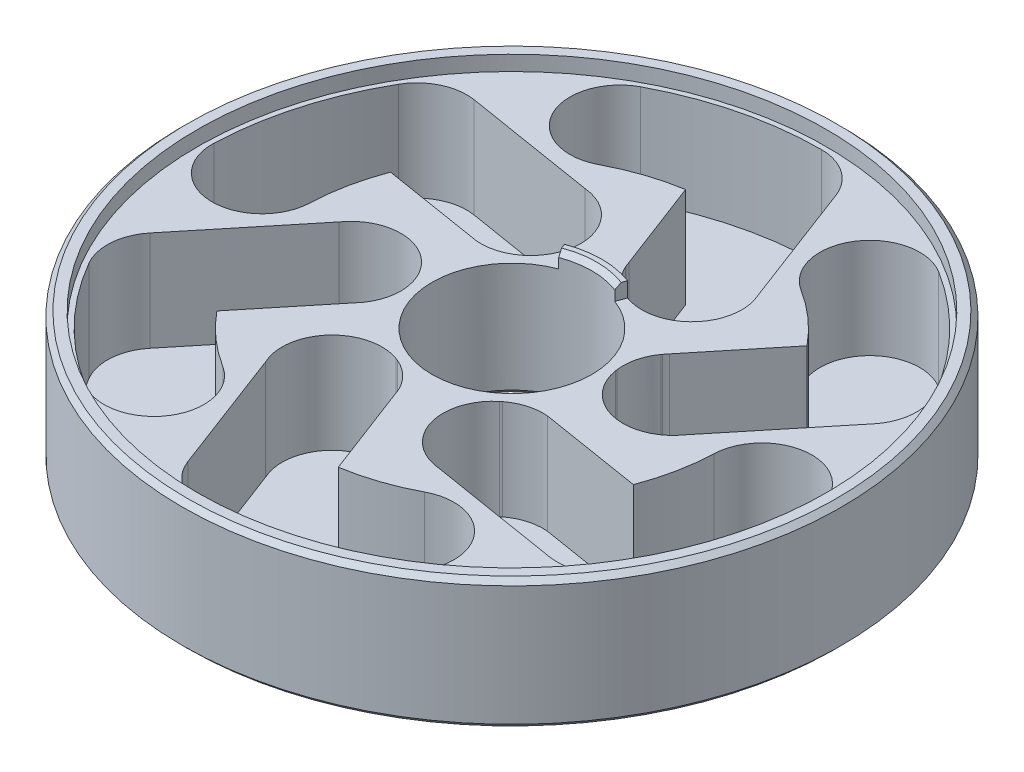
ISO-10303-21;
HEADER;
FILE_DESCRIPTION(('STEP AP214'),'2;1');
FILE_NAME('part.step','',(''),(''),'','','');
FILE_SCHEMA(('AUTOMOTIVE_DESIGN { 1 0 10303 214 1 1 1 1 }'));
ENDSEC;
DATA;
#1=APPLICATION_CONTEXT('core data for automotive mechanical design processes');
#2=APPLICATION_PROTOCOL_DEFINITION('international standard','automotive_design',2000,#1);
#3=PRODUCT_CONTEXT('',#1,'mechanical');
#4=PRODUCT('Part','Part','',(#3));
#5=PRODUCT_RELATED_PRODUCT_CATEGORY('part','',(#4));
#6=PRODUCT_DEFINITION_FORMATION('','',#4);
#7=PRODUCT_DEFINITION_CONTEXT('part definition',#1,'design');
#8=PRODUCT_DEFINITION('design','',#6,#7);
#9=PRODUCT_DEFINITION_SHAPE('','',#8);
#10=(LENGTH_UNIT() NAMED_UNIT(*) SI_UNIT(.MILLI.,.METRE.));
#11=(NAMED_UNIT(*) PLANE_ANGLE_UNIT() SI_UNIT($,.RADIAN.));
#12=(NAMED_UNIT(*) SI_UNIT($,.STERADIAN.) SOLID_ANGLE_UNIT());
#13=UNCERTAINTY_MEASURE_WITH_UNIT(LENGTH_MEASURE(1.E-05),#10,'distance_accuracy_value','');
#14=(GEOMETRIC_REPRESENTATION_CONTEXT(3) GLOBAL_UNCERTAINTY_ASSIGNED_CONTEXT((#13)) GLOBAL_UNIT_ASSIGNED_CONTEXT((#10,
#11,#12)) REPRESENTATION_CONTEXT('',''));
#15=CARTESIAN_POINT('',(0.,0.,0.));
#16=DIRECTION('',(0.,0.,1.));
#17=DIRECTION('',(1.,0.,0.));
#18=AXIS2_PLACEMENT_3D('',#15,#16,#17);
#19=CARTESIAN_POINT('',(3.29016211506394,-11.5,2.68084768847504));
#20=DIRECTION('',(-0.775237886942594,0.,-0.631669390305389));
#21=DIRECTION('',(-0.631669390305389,0.,0.775237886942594));
#22=AXIS2_PLACEMENT_3D('',#19,#20,#21);
#23=PLANE('',#22);
#24=DIRECTION('',(-0.631669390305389,0.,0.775237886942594));
#25=VECTOR('',#24,1.);
#26=CARTESIAN_POINT('',(3.29016211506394,-11.5,2.68084768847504));
#27=LINE('',#26,#25);
#28=CARTESIAN_POINT('',(9.7803560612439,-11.5,-5.28446504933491));
#29=VERTEX_POINT('',#28);
#30=CARTESIAN_POINT('',(9.71503123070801,-11.5,-5.20429291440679));
#31=VERTEX_POINT('',#30);
#32=EDGE_CURVE('E521',#29,#31,#27,.T.);
#33=ORIENTED_EDGE('',*,*,#32,.F.);
#34=DIRECTION('',(0.,1.,0.));
#35=VECTOR('',#34,1.);
#36=CARTESIAN_POINT('',(9.78035606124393,-13.,-5.28446504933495));
#37=LINE('',#36,#35);
#38=CARTESIAN_POINT('',(9.78035606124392,-1.5,-5.28446504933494));
#39=VERTEX_POINT('',#38);
#40=EDGE_CURVE('E480',#29,#39,#37,.T.);
#41=ORIENTED_EDGE('',*,*,#40,.T.);
#42=DIRECTION('',(-0.631669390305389,0.,0.775237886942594));
#43=VECTOR('',#42,1.);
#44=CARTESIAN_POINT('',(3.29016211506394,-1.5,2.68084768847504));
#45=LINE('',#44,#43);
#46=CARTESIAN_POINT('',(9.71503123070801,-1.5,-5.20429291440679));
#47=VERTEX_POINT('',#46);
#48=EDGE_CURVE('E44',#39,#47,#45,.T.);
#49=ORIENTED_EDGE('',*,*,#48,.T.);
#50=DIRECTION('',(0.,1.,0.));
#51=VECTOR('',#50,1.);
#52=CARTESIAN_POINT('',(9.71503123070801,-11.5,-5.20429291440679));
#53=LINE('',#52,#51);
#54=EDGE_CURVE('E534',#31,#47,#53,.T.);
#55=ORIENTED_EDGE('',*,*,#54,.F.);
#56=EDGE_LOOP('',(#33,#41,#49,#55));
#57=FACE_BOUND('',#56,.T.);
#58=ADVANCED_FACE('F40',(#57),#23,.F.);
#59=CARTESIAN_POINT('',(0.,-11.5,0.));
#60=DIRECTION('',(0.,1.,0.));
#61=DIRECTION('',(-0.866025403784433,0.,0.50000000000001));
#62=AXIS2_PLACEMENT_3D('',#59,#60,#61);
#63=PLANE('',#62);
#64=CARTESIAN_POINT('',(13.8064944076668,-11.5,-2.3196362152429));
#65=DIRECTION('',(0.,1.,0.));
#66=DIRECTION('',(0.,0.,1.));
#67=AXIS2_PLACEMENT_3D('',#64,#65,#66);
#68=CIRCLE('',#67,5.);
#69=CARTESIAN_POINT('',(8.87560354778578,-11.5,-1.49119470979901));
#70=VERTEX_POINT('',#69);
#71=EDGE_CURVE('E12',#29,#70,#68,.T.);
#72=ORIENTED_EDGE('',*,*,#71,.F.);
#73=ORIENTED_EDGE('',*,*,#32,.T.);
#74=CARTESIAN_POINT('',(13.8064944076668,-11.5,-2.3196362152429));
#75=DIRECTION('',(0.,1.,0.));
#76=DIRECTION('',(-0.866025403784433,0.,0.50000000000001));
#77=AXIS2_PLACEMENT_3D('',#74,#75,#76);
#78=CIRCLE('',#77,5.00612776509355);
#79=CARTESIAN_POINT('',(8.84055074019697,-11.5,-1.6866127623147));
#80=VERTEX_POINT('',#79);
#81=EDGE_CURVE('E1086',#31,#80,#78,.T.);
#82=ORIENTED_EDGE('',*,*,#81,.T.);
#83=CARTESIAN_POINT('',(0.,-11.5,0.));
#84=DIRECTION('',(0.,1.,0.));
#85=DIRECTION('',(-0.866025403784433,0.,0.50000000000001));
#86=AXIS2_PLACEMENT_3D('',#83,#84,#85);
#87=CIRCLE('',#86,9.);
#88=EDGE_CURVE('E1091',#80,#70,#87,.F.);
#89=ORIENTED_EDGE('',*,*,#88,.T.);
#90=EDGE_LOOP('',(#72,#73,#82,#89));
#91=FACE_BOUND('',#90,.T.);
#92=ADVANCED_FACE('F817',(#91),#63,.T.);
#93=CARTESIAN_POINT('',(3.96676325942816,-11.5,-1.50894012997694));
#94=DIRECTION('',(-0.934660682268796,0.,0.355541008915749));
#95=DIRECTION('',(0.355541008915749,0.,0.934660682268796));
#96=AXIS2_PLACEMENT_3D('',#93,#94,#95);
#97=PLANE('',#96);
#98=DIRECTION('',(0.355541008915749,0.,0.934660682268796));
#99=VECTOR('',#98,1.);
#100=CARTESIAN_POINT('',(3.96676325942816,-11.5,-1.50894012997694));
#101=LINE('',#100,#99);
#102=CARTESIAN_POINT('',(0.313697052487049,-11.5,-11.1122693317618));
#103=VERTEX_POINT('',#102);
#104=CARTESIAN_POINT('',(0.350465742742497,-11.5,-11.0156103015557));
#105=VERTEX_POINT('',#104);
#106=EDGE_CURVE('E733',#103,#105,#101,.T.);
#107=ORIENTED_EDGE('',*,*,#106,.F.);
#108=DIRECTION('',(0.,1.,0.));
#109=VECTOR('',#108,1.);
#110=CARTESIAN_POINT('',(0.313697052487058,-13.,-11.1122693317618));
#111=LINE('',#110,#109);
#112=CARTESIAN_POINT('',(0.313697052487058,-1.5,-11.1122693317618));
#113=VERTEX_POINT('',#112);
#114=EDGE_CURVE('E1052',#103,#113,#111,.T.);
#115=ORIENTED_EDGE('',*,*,#114,.T.);
#116=DIRECTION('',(0.355541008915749,0.,0.934660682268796));
#117=VECTOR('',#116,1.);
#118=CARTESIAN_POINT('',(3.96676325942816,-1.5,-1.50894012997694));
#119=LINE('',#118,#117);
#120=CARTESIAN_POINT('',(0.350465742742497,-1.5,-11.0156103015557));
#121=VERTEX_POINT('',#120);
#122=EDGE_CURVE('E718',#113,#121,#119,.T.);
#123=ORIENTED_EDGE('',*,*,#122,.T.);
#124=DIRECTION('',(0.,1.,0.));
#125=VECTOR('',#124,1.);
#126=CARTESIAN_POINT('',(0.350465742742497,-11.5,-11.0156103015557));
#127=LINE('',#126,#125);
#128=EDGE_CURVE('E749',#105,#121,#127,.T.);
#129=ORIENTED_EDGE('',*,*,#128,.F.);
#130=EDGE_LOOP('',(#107,#115,#123,#129));
#131=FACE_BOUND('',#130,.T.);
#132=ADVANCED_FACE('F823',(#131),#97,.F.);
#133=CARTESIAN_POINT('',(0.,-11.5,0.));
#134=DIRECTION('',(0.,1.,0.));
#135=DIRECTION('',(0.,0.,1.));
#136=AXIS2_PLACEMENT_3D('',#133,#134,#135);
#137=PLANE('',#136);
#138=CARTESIAN_POINT('',(4.89438331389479,-11.5,-13.1165930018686));
#139=DIRECTION('',(0.,1.,0.));
#140=DIRECTION('',(0.,0.,1.));
#141=AXIS2_PLACEMENT_3D('',#138,#139,#140);
#142=CIRCLE('',#141,5.);
#143=CARTESIAN_POINT('',(3.14638927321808,-11.5,-8.43209550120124));
#144=VERTEX_POINT('',#143);
#145=EDGE_CURVE('E64',#103,#144,#142,.T.);
#146=ORIENTED_EDGE('',*,*,#145,.F.);
#147=ORIENTED_EDGE('',*,*,#106,.T.);
#148=CARTESIAN_POINT('',(4.89438331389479,-11.5,-13.1165930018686));
#149=DIRECTION('',(0.,1.,0.));
#150=DIRECTION('',(0.,0.,1.));
#151=AXIS2_PLACEMENT_3D('',#148,#149,#150);
#152=CIRCLE('',#151,5.00612776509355);
#153=CARTESIAN_POINT('',(2.95962587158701,-11.5,-8.49944790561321));
#154=VERTEX_POINT('',#153);
#155=EDGE_CURVE('E732',#105,#154,#152,.T.);
#156=ORIENTED_EDGE('',*,*,#155,.T.);
#157=CARTESIAN_POINT('',(0.,-11.5,0.));
#158=DIRECTION('',(0.,1.,0.));
#159=DIRECTION('',(0.,0.,1.));
#160=AXIS2_PLACEMENT_3D('',#157,#158,#159);
#161=CIRCLE('',#160,9.);
#162=EDGE_CURVE('E738',#154,#144,#161,.F.);
#163=ORIENTED_EDGE('',*,*,#162,.T.);
#164=EDGE_LOOP('',(#146,#147,#156,#163));
#165=FACE_BOUND('',#164,.T.);
#166=ADVANCED_FACE('F964',(#165),#137,.T.);
#167=CARTESIAN_POINT('',(0.,0.,0.));
#168=DIRECTION('',(0.,1.,0.));
#169=DIRECTION('',(0.,0.,1.));
#170=AXIS2_PLACEMENT_3D('',#167,#168,#169);
#171=PLANE('',#170);
#172=DIRECTION('',(0.351123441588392,0.,0.936329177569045));
#173=VECTOR('',#172,1.);
#174=CARTESIAN_POINT('',(-2.80898753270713,0.,-7.49063342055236));
#175=LINE('',#174,#173);
#176=CARTESIAN_POINT('',(-3.16011097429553,0.,-8.4269625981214));
#177=VERTEX_POINT('',#176);
#178=CARTESIAN_POINT('',(-2.98454925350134,0.,-7.95879800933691));
#179=VERTEX_POINT('',#178);
#180=EDGE_CURVE('E1282',#177,#179,#175,.T.);
#181=ORIENTED_EDGE('',*,*,#180,.T.);
#182=CARTESIAN_POINT('',(0.,0.,0.));
#183=DIRECTION('',(0.,1.,0.));
#184=DIRECTION('',(0.,0.,1.));
#185=AXIS2_PLACEMENT_3D('',#182,#183,#184);
#186=CIRCLE('',#185,8.50000000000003);
#187=CARTESIAN_POINT('',(2.98454925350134,0.,-7.95879800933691));
#188=VERTEX_POINT('',#187);
#189=EDGE_CURVE('E1026',#179,#188,#186,.F.);
#190=ORIENTED_EDGE('',*,*,#189,.T.);
#191=DIRECTION('',(0.351123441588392,0.,-0.936329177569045));
#192=VECTOR('',#191,1.);
#193=CARTESIAN_POINT('',(2.80898753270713,0.,-7.49063342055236));
#194=LINE('',#193,#192);
#195=CARTESIAN_POINT('',(3.16011097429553,0.,-8.4269625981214));
#196=VERTEX_POINT('',#195);
#197=EDGE_CURVE('E1276',#188,#196,#194,.T.);
#198=ORIENTED_EDGE('',*,*,#197,.T.);
#199=CARTESIAN_POINT('',(0.,0.,0.));
#200=DIRECTION('',(0.,1.,0.));
#201=DIRECTION('',(0.,0.,1.));
#202=AXIS2_PLACEMENT_3D('',#199,#200,#201);
#203=CIRCLE('',#202,9.);
#204=EDGE_CURVE('E1262',#196,#177,#203,.T.);
#205=ORIENTED_EDGE('',*,*,#204,.T.);
#206=EDGE_LOOP('',(#181,#190,#198,#205));
#207=FACE_BOUND('',#206,.T.);
#208=ADVANCED_FACE('F787',(#207),#171,.T.);
#209=CARTESIAN_POINT('',(0.,-13.,0.));
#210=DIRECTION('',(0.,1.,0.));
#211=DIRECTION('',(0.,0.,1.));
#212=AXIS2_PLACEMENT_3D('',#209,#210,#211);
#213=CYLINDRICAL_SURFACE('',#212,8.);
#214=CARTESIAN_POINT('',(0.,-12.5,0.));
#215=DIRECTION('',(0.,1.,0.));
#216=DIRECTION('',(0.,0.,1.));
#217=AXIS2_PLACEMENT_3D('',#214,#215,#216);
#218=CIRCLE('',#217,8.);
#219=CARTESIAN_POINT('',(0.,-12.5,8.));
#220=VERTEX_POINT('',#219);
#221=EDGE_CURVE('E1018',#220,#220,#218,.F.);
#222=ORIENTED_EDGE('',*,*,#221,.T.);
#223=EDGE_LOOP('',(#222));
#224=FACE_BOUND('',#223,.T.);
#225=DIRECTION('',(0.,1.,0.));
#226=VECTOR('',#225,1.);
#227=CARTESIAN_POINT('',(2.80898753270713,-1.5,-7.49063342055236));
#228=LINE('',#227,#226);
#229=CARTESIAN_POINT('',(2.80898753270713,-1.5,-7.49063342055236));
#230=VERTEX_POINT('',#229);
#231=CARTESIAN_POINT('',(2.80898753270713,-0.500000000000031,-7.49063342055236));
#232=VERTEX_POINT('',#231);
#233=EDGE_CURVE('E1002',#230,#232,#228,.T.);
#234=ORIENTED_EDGE('',*,*,#233,.T.);
#235=CARTESIAN_POINT('',(0.,-0.500000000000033,0.));
#236=DIRECTION('',(0.,1.,0.));
#237=DIRECTION('',(0.,0.,1.));
#238=AXIS2_PLACEMENT_3D('',#235,#236,#237);
#239=CIRCLE('',#238,8.);
#240=CARTESIAN_POINT('',(-2.80898753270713,-0.500000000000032,-7.49063342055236));
#241=VERTEX_POINT('',#240);
#242=EDGE_CURVE('E1023',#232,#241,#239,.T.);
#243=ORIENTED_EDGE('',*,*,#242,.T.);
#244=DIRECTION('',(0.,1.,0.));
#245=VECTOR('',#244,1.);
#246=CARTESIAN_POINT('',(-2.80898753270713,-1.5,-7.49063342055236));
#247=LINE('',#246,#245);
#248=CARTESIAN_POINT('',(-2.80898753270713,-1.5,-7.49063342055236));
#249=VERTEX_POINT('',#248);
#250=EDGE_CURVE('E991',#249,#241,#247,.T.);
#251=ORIENTED_EDGE('',*,*,#250,.F.);
#252=CARTESIAN_POINT('',(0.,-1.5,0.));
#253=DIRECTION('',(0.,1.,0.));
#254=DIRECTION('',(0.,0.,1.));
#255=AXIS2_PLACEMENT_3D('',#252,#253,#254);
#256=CIRCLE('',#255,8.);
#257=EDGE_CURVE('E1014',#249,#230,#256,.T.);
#258=ORIENTED_EDGE('',*,*,#257,.T.);
#259=EDGE_LOOP('',(#234,#243,#251,#258));
#260=FACE_BOUND('',#259,.T.);
#261=ADVANCED_FACE('F783',(#224,#260),#213,.F.);
#262=CARTESIAN_POINT('',(0.,-13.,0.));
#263=DIRECTION('',(0.,1.,0.));
#264=DIRECTION('',(0.,0.,1.));
#265=AXIS2_PLACEMENT_3D('',#262,#263,#264);
#266=CYLINDRICAL_SURFACE('',#265,33.);
#267=CARTESIAN_POINT('',(0.,-12.5,0.));
#268=DIRECTION('',(0.,1.,0.));
#269=DIRECTION('',(0.,0.,1.));
#270=AXIS2_PLACEMENT_3D('',#267,#268,#269);
#271=CIRCLE('',#270,33.);
#272=CARTESIAN_POINT('',(0.,-12.5,33.));
#273=VERTEX_POINT('',#272);
#274=EDGE_CURVE('E1039',#273,#273,#271,.T.);
#275=CARTESIAN_POINT('',(0.,-0.499999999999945,0.));
#276=DIRECTION('',(0.,1.,0.));
#277=DIRECTION('',(0.,0.,1.));
#278=AXIS2_PLACEMENT_3D('',#275,#276,#277);
#279=CIRCLE('',#278,33.);
#280=CARTESIAN_POINT('',(0.,-0.499999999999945,33.));
#281=VERTEX_POINT('',#280);
#282=EDGE_CURVE('E1036',#281,#281,#279,.F.);
#283=CARTESIAN_POINT('',(0.,-12.5,33.));
#284=CARTESIAN_POINT('',(0.,-12.375,33.));
#285=CARTESIAN_POINT('',(0.,-12.25,33.));
#286=CARTESIAN_POINT('',(0.,-12.,33.));
#287=CARTESIAN_POINT('',(0.,-11.875,33.));
#288=CARTESIAN_POINT('',(0.,-11.625,33.));
#289=CARTESIAN_POINT('',(0.,-11.5,33.));
#290=CARTESIAN_POINT('',(0.,-11.25,33.));
#291=CARTESIAN_POINT('',(0.,-11.125,33.));
#292=CARTESIAN_POINT('',(0.,-10.875,33.));
#293=CARTESIAN_POINT('',(0.,-10.75,33.));
#294=CARTESIAN_POINT('',(0.,-10.5,33.));
#295=CARTESIAN_POINT('',(0.,-10.375,33.));
#296=CARTESIAN_POINT('',(0.,-10.125,33.));
#297=CARTESIAN_POINT('',(0.,-9.99999999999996,33.));
#298=CARTESIAN_POINT('',(0.,-9.74999999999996,33.));
#299=CARTESIAN_POINT('',(0.,-9.62499999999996,33.));
#300=CARTESIAN_POINT('',(0.,-9.37499999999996,33.));
#301=CARTESIAN_POINT('',(0.,-9.24999999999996,33.));
#302=CARTESIAN_POINT('',(0.,-8.99999999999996,33.));
#303=CARTESIAN_POINT('',(0.,-8.87499999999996,33.));
#304=CARTESIAN_POINT('',(0.,-8.62499999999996,33.));
#305=CARTESIAN_POINT('',(0.,-8.49999999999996,33.));
#306=CARTESIAN_POINT('',(0.,-8.24999999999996,33.));
#307=CARTESIAN_POINT('',(0.,-8.12499999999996,33.));
#308=CARTESIAN_POINT('',(0.,-7.87499999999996,33.));
#309=CARTESIAN_POINT('',(0.,-7.74999999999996,33.));
#310=CARTESIAN_POINT('',(0.,-7.49999999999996,33.));
#311=CARTESIAN_POINT('',(0.,-7.37499999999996,33.));
#312=CARTESIAN_POINT('',(0.,-7.12499999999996,33.));
#313=CARTESIAN_POINT('',(0.,-6.99999999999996,33.));
#314=CARTESIAN_POINT('',(0.,-6.74999999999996,33.));
#315=CARTESIAN_POINT('',(0.,-6.62499999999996,33.));
#316=CARTESIAN_POINT('',(0.,-6.37499999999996,33.));
#317=CARTESIAN_POINT('',(0.,-6.24999999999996,33.));
#318=CARTESIAN_POINT('',(0.,-5.99999999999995,33.));
#319=CARTESIAN_POINT('',(0.,-5.87499999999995,33.));
#320=CARTESIAN_POINT('',(0.,-5.62499999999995,33.));
#321=CARTESIAN_POINT('',(0.,-5.49999999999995,33.));
#322=CARTESIAN_POINT('',(0.,-5.24999999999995,33.));
#323=CARTESIAN_POINT('',(0.,-5.12499999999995,33.));
#324=CARTESIAN_POINT('',(0.,-4.87499999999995,33.));
#325=CARTESIAN_POINT('',(0.,-4.74999999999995,33.));
#326=CARTESIAN_POINT('',(0.,-4.49999999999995,33.));
#327=CARTESIAN_POINT('',(0.,-4.37499999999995,33.));
#328=CARTESIAN_POINT('',(0.,-4.12499999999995,33.));
#329=CARTESIAN_POINT('',(0.,-3.99999999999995,33.));
#330=CARTESIAN_POINT('',(0.,-3.74999999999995,33.));
#331=CARTESIAN_POINT('',(0.,-3.62499999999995,33.));
#332=CARTESIAN_POINT('',(0.,-3.37499999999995,33.));
#333=CARTESIAN_POINT('',(0.,-3.24999999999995,33.));
#334=CARTESIAN_POINT('',(0.,-2.99999999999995,33.));
#335=CARTESIAN_POINT('',(0.,-2.87499999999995,33.));
#336=CARTESIAN_POINT('',(0.,-2.62499999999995,33.));
#337=CARTESIAN_POINT('',(0.,-2.49999999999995,33.));
#338=CARTESIAN_POINT('',(0.,-2.24999999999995,33.));
#339=CARTESIAN_POINT('',(0.,-2.12499999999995,33.));
#340=CARTESIAN_POINT('',(0.,-1.87499999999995,33.));
#341=CARTESIAN_POINT('',(0.,-1.74999999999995,33.));
#342=CARTESIAN_POINT('',(0.,-1.49999999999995,33.));
#343=CARTESIAN_POINT('',(0.,-1.37499999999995,33.));
#344=CARTESIAN_POINT('',(0.,-1.12499999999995,33.));
#345=CARTESIAN_POINT('',(0.,-0.999999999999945,33.));
#346=CARTESIAN_POINT('',(0.,-0.749999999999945,33.));
#347=CARTESIAN_POINT('',(0.,-0.624999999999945,33.));
#348=CARTESIAN_POINT('',(0.,-0.499999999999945,33.));
#349=B_SPLINE_CURVE_WITH_KNOTS('',3,(#283,#284,#285,#286,#287,#288,#289,#290,#291,#292,#293,
#294,#295,#296,#297,#298,#299,#300,#301,#302,#303,#304,#305,#306,#307,#308,#309,#310,#311,#312,
#313,#314,#315,#316,#317,#318,#319,#320,#321,#322,#323,#324,#325,#326,#327,#328,#329,#330,#331,
#332,#333,#334,#335,#336,#337,#338,#339,#340,#341,#342,#343,#344,#345,#346,#347,#348),
.UNSPECIFIED.,.F.,.F.,(4,2,2,2,2,2,2,2,2,2,2,2,2,2,2,2,2,2,2,2,2,2,2,2,2,2,2,2,2,2,2,2,4),(0.,
0.375,0.750000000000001,1.125,1.5,1.875,2.25,2.625,3.,3.375,3.75,4.12500000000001,
4.50000000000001,4.87500000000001,5.25000000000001,5.62500000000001,6.00000000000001,
6.37500000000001,6.75000000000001,7.12500000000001,7.50000000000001,7.87500000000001,
8.25000000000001,8.62500000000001,9.00000000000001,9.37500000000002,9.75000000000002,10.125,
10.5,10.875,11.25,11.625,12.),.UNSPECIFIED.);
#350=EDGE_CURVE('BSEAM786',#273,#281,#349,.T.);
#351=ORIENTED_EDGE('',*,*,#274,.T.);
#352=ORIENTED_EDGE('',*,*,#282,.T.);
#353=ORIENTED_EDGE('',*,*,#350,.T.);
#354=ORIENTED_EDGE('',*,*,#350,.F.);
#355=EDGE_LOOP('',(#351,#353,#352,#354));
#356=FACE_BOUND('',#355,.T.);
#357=ADVANCED_FACE('F786',(#356),#266,.T.);
#358=CARTESIAN_POINT('',(0.,-13.,0.));
#359=DIRECTION('',(0.,1.,0.));
#360=DIRECTION('',(0.,0.,1.));
#361=AXIS2_PLACEMENT_3D('',#358,#359,#360);
#362=PLANE('',#361);
#363=CARTESIAN_POINT('',(13.8064944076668,-13.,-2.3196362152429));
#364=DIRECTION('',(0.,1.,0.));
#365=DIRECTION('',(0.,0.,1.));
#366=AXIS2_PLACEMENT_3D('',#363,#364,#365);
#367=CIRCLE('',#366,5.);
#368=CARTESIAN_POINT('',(13.8064944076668,-13.,2.6803637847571));
#369=VERTEX_POINT('',#368);
#370=EDGE_CURVE('E481',#369,#369,#367,.T.);
#371=ORIENTED_EDGE('',*,*,#370,.T.);
#372=EDGE_LOOP('',(#371));
#373=FACE_BOUND('',#372,.T.);
#374=CARTESIAN_POINT('',(4.89438331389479,-13.,-13.1165930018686));
#375=DIRECTION('',(0.,1.,0.));
#376=DIRECTION('',(0.,0.,1.));
#377=AXIS2_PLACEMENT_3D('',#374,#375,#376);
#378=CIRCLE('',#377,5.);
#379=CARTESIAN_POINT('',(4.89438331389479,-13.,-8.1165930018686));
#380=VERTEX_POINT('',#379);
#381=EDGE_CURVE('E1053',#380,#380,#378,.T.);
#382=ORIENTED_EDGE('',*,*,#381,.T.);
#383=EDGE_LOOP('',(#382));
#384=FACE_BOUND('',#383,.T.);
#385=CARTESIAN_POINT('',(0.,-13.,0.));
#386=DIRECTION('',(0.,1.,0.));
#387=DIRECTION('',(0.,0.,1.));
#388=AXIS2_PLACEMENT_3D('',#385,#386,#387);
#389=CIRCLE('',#388,8.49999999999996);
#390=CARTESIAN_POINT('',(0.,-13.,8.49999999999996));
#391=VERTEX_POINT('',#390);
#392=EDGE_CURVE('E1033',#391,#391,#389,.T.);
#393=ORIENTED_EDGE('',*,*,#392,.T.);
#394=EDGE_LOOP('',(#393));
#395=FACE_BOUND('',#394,.T.);
#396=CARTESIAN_POINT('',(0.,-13.,0.));
#397=DIRECTION('',(0.,1.,0.));
#398=DIRECTION('',(0.,0.,1.));
#399=AXIS2_PLACEMENT_3D('',#396,#397,#398);
#400=CIRCLE('',#399,32.5);
#401=CARTESIAN_POINT('',(0.,-13.,32.5));
#402=VERTEX_POINT('',#401);
#403=EDGE_CURVE('E1030',#402,#402,#400,.F.);
#404=ORIENTED_EDGE('',*,*,#403,.T.);
#405=EDGE_LOOP('',(#404));
#406=FACE_BOUND('',#405,.T.);
#407=ADVANCED_FACE('F789',(#373,#384,#395,#406),#362,.F.);
#408=CARTESIAN_POINT('',(0.,0.,0.));
#409=DIRECTION('',(0.,1.,0.));
#410=DIRECTION('',(0.,0.,1.));
#411=AXIS2_PLACEMENT_3D('',#408,#409,#410);
#412=CIRCLE('',#411,32.5);
#413=CARTESIAN_POINT('',(0.,0.,32.5));
#414=VERTEX_POINT('',#413);
#415=EDGE_CURVE('E1042',#414,#414,#412,.T.);
#416=ORIENTED_EDGE('',*,*,#415,.T.);
#417=EDGE_LOOP('',(#416));
#418=FACE_BOUND('',#417,.T.);
#419=CARTESIAN_POINT('',(0.,0.,0.));
#420=DIRECTION('',(0.,1.,0.));
#421=DIRECTION('',(0.,0.,1.));
#422=AXIS2_PLACEMENT_3D('',#419,#420,#421);
#423=CIRCLE('',#422,31.5);
#424=CARTESIAN_POINT('',(0.,0.,31.5));
#425=VERTEX_POINT('',#424);
#426=EDGE_CURVE('E1006',#425,#425,#423,.T.);
#427=ORIENTED_EDGE('',*,*,#426,.F.);
#428=EDGE_LOOP('',(#427));
#429=FACE_BOUND('',#428,.T.);
#430=ADVANCED_FACE('F781',(#418,#429),#171,.T.);
#431=CARTESIAN_POINT('',(0.,-1.5,0.));
#432=DIRECTION('',(0.,1.,0.));
#433=DIRECTION('',(0.,0.,1.));
#434=AXIS2_PLACEMENT_3D('',#431,#432,#433);
#435=CYLINDRICAL_SURFACE('',#434,31.5);
#436=CARTESIAN_POINT('',(0.,-1.5,0.));
#437=DIRECTION('',(0.,1.,0.));
#438=DIRECTION('',(0.,0.,1.));
#439=AXIS2_PLACEMENT_3D('',#436,#437,#438);
#440=CIRCLE('',#439,31.5);
#441=CARTESIAN_POINT('',(0.,-1.5,31.5));
#442=VERTEX_POINT('',#441);
#443=EDGE_CURVE('E1015',#442,#442,#440,.T.);
#444=ORIENTED_EDGE('',*,*,#443,.F.);
#445=EDGE_LOOP('',(#444));
#446=FACE_BOUND('',#445,.T.);
#447=ORIENTED_EDGE('',*,*,#426,.T.);
#448=EDGE_LOOP('',(#447));
#449=FACE_BOUND('',#448,.T.);
#450=ADVANCED_FACE('F775',(#446,#449),#435,.F.);
#451=CARTESIAN_POINT('',(0.,-1.5,0.));
#452=DIRECTION('',(0.,1.,0.));
#453=DIRECTION('',(0.,0.,1.));
#454=AXIS2_PLACEMENT_3D('',#451,#452,#453);
#455=PLANE('',#454);
#456=CARTESIAN_POINT('',(9.78035606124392,-1.5,-5.28446504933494));
#457=CARTESIAN_POINT('',(9.92565309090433,-1.5,-5.48177355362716));
#458=CARTESIAN_POINT('',(10.0895464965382,-1.5,-5.66392959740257));
#459=B_SPLINE_CURVE_WITH_KNOTS('',2,(#456,#457,#458),.UNSPECIFIED.,.F.,.F.,(3,3),(0.,1.),.UNSPECIFIED.);
#460=CARTESIAN_POINT('',(10.0895464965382,-1.5,-5.66392959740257));
#461=VERTEX_POINT('',#460);
#462=EDGE_CURVE('E473',#39,#461,#459,.T.);
#463=ORIENTED_EDGE('',*,*,#462,.T.);
#464=CARTESIAN_POINT('',(16.2814976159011,-1.5,-13.263213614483));
#465=VERTEX_POINT('',#464);
#466=EDGE_CURVE('E490',#465,#461,#45,.T.);
#467=ORIENTED_EDGE('',*,*,#466,.F.);
#468=CARTESIAN_POINT('',(0.,-1.5,0.));
#469=DIRECTION('',(0.,-1.,0.));
#470=DIRECTION('',(-0.866025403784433,0.,0.50000000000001));
#471=AXIS2_PLACEMENT_3D('',#468,#469,#470);
#472=CIRCLE('',#471,21.);
#473=CARTESIAN_POINT('',(11.1588557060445,-1.5,-17.7898830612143));
#474=VERTEX_POINT('',#473);
#475=EDGE_CURVE('E1125',#474,#465,#472,.T.);
#476=ORIENTED_EDGE('',*,*,#475,.F.);
#477=CARTESIAN_POINT('',(13.8157261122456,-1.5,-22.0255695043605));
#478=DIRECTION('',(0.,1.,0.));
#479=DIRECTION('',(-0.866025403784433,0.,0.50000000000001));
#480=AXIS2_PLACEMENT_3D('',#477,#478,#479);
#481=CIRCLE('',#480,5.);
#482=CARTESIAN_POINT('',(16.4725965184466,-1.5,-26.2612559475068));
#483=VERTEX_POINT('',#482);
#484=EDGE_CURVE('E1129',#483,#474,#481,.T.);
#485=ORIENTED_EDGE('',*,*,#484,.F.);
#486=CARTESIAN_POINT('',(0.,-1.5,0.));
#487=DIRECTION('',(0.,1.,0.));
#488=DIRECTION('',(-0.866025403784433,0.,0.50000000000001));
#489=AXIS2_PLACEMENT_3D('',#486,#487,#488);
#490=CIRCLE('',#489,31.);
#491=CARTESIAN_POINT('',(26.8467875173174,-1.5,-15.5000000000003));
#492=VERTEX_POINT('',#491);
#493=EDGE_CURVE('E1115',#492,#483,#490,.T.);
#494=ORIENTED_EDGE('',*,*,#493,.F.);
#495=CARTESIAN_POINT('',(22.5166604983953,-1.5,-13.0000000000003));
#496=DIRECTION('',(0.,1.,0.));
#497=DIRECTION('',(-0.866025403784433,0.,0.50000000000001));
#498=AXIS2_PLACEMENT_3D('',#495,#496,#497);
#499=CIRCLE('',#498,4.99999895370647);
#500=CARTESIAN_POINT('',(26.3914756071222,-1.5,-9.83996876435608));
#501=VERTEX_POINT('',#500);
#502=EDGE_CURVE('E518',#501,#492,#499,.T.);
#503=ORIENTED_EDGE('',*,*,#502,.F.);
#504=DIRECTION('',(-0.632360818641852,0.,0.774673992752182));
#505=VECTOR('',#504,1.);
#506=CARTESIAN_POINT('',(11.0177071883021,-1.5,8.99367527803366));
#507=LINE('',#506,#505);
#508=CARTESIAN_POINT('',(17.8979575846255,-1.5,0.565020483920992));
#509=VERTEX_POINT('',#508);
#510=EDGE_CURVE('E515',#501,#509,#507,.T.);
#511=ORIENTED_EDGE('',*,*,#510,.T.);
#512=CARTESIAN_POINT('',(13.8064944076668,-1.5,-2.3196362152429));
#513=DIRECTION('',(0.,1.,0.));
#514=DIRECTION('',(-0.866025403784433,0.,0.50000000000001));
#515=AXIS2_PLACEMENT_3D('',#512,#513,#514);
#516=CIRCLE('',#515,5.00612776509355);
#517=CARTESIAN_POINT('',(8.87200733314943,-1.5,-1.47574492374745));
#518=VERTEX_POINT('',#517);
#519=EDGE_CURVE('E500',#518,#509,#516,.T.);
#520=ORIENTED_EDGE('',*,*,#519,.F.);
#521=DIRECTION('',(-0.986446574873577,0.,0.164082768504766));
#522=VECTOR('',#521,1.);
#523=CARTESIAN_POINT('',(0.,-1.5,0.));
#524=LINE('',#523,#522);
#525=CARTESIAN_POINT('',(8.87801917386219,-1.5,-1.47674491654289));
#526=VERTEX_POINT('',#525);
#527=EDGE_CURVE('E512',#526,#518,#524,.T.);
#528=ORIENTED_EDGE('',*,*,#527,.F.);
#529=CARTESIAN_POINT('',(0.,-1.5,0.));
#530=DIRECTION('',(0.,1.,0.));
#531=DIRECTION('',(-0.866025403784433,0.,0.50000000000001));
#532=AXIS2_PLACEMENT_3D('',#529,#530,#531);
#533=CIRCLE('',#532,9.);
#534=CARTESIAN_POINT('',(8.84055074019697,-1.5,-1.6866127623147));
#535=VERTEX_POINT('',#534);
#536=EDGE_CURVE('E498',#535,#526,#533,.F.);
#537=ORIENTED_EDGE('',*,*,#536,.F.);
#538=EDGE_CURVE('E496',#47,#535,#516,.T.);
#539=ORIENTED_EDGE('',*,*,#538,.F.);
#540=ORIENTED_EDGE('',*,*,#48,.F.);
#541=EDGE_LOOP('',(#463,#467,#476,#485,#494,#503,#511,#520,#528,#537,#539,#540));
#542=FACE_BOUND('',#541,.T.);
#543=CARTESIAN_POINT('',(0.313697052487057,-1.5,-11.1122693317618));
#544=CARTESIAN_POINT('',(0.215471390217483,-1.5,-11.3367545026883));
#545=CARTESIAN_POINT('',(0.139666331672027,-1.5,-11.5697683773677));
#546=B_SPLINE_CURVE_WITH_KNOTS('',2,(#543,#544,#545),.UNSPECIFIED.,.F.,.F.,(3,3),(0.,1.),.UNSPECIFIED.);
#547=CARTESIAN_POINT('',(0.139666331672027,-1.5,-11.5697683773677));
#548=VERTEX_POINT('',#547);
#549=EDGE_CURVE('E1307',#113,#548,#546,.T.);
#550=ORIENTED_EDGE('',*,*,#549,.T.);
#551=CARTESIAN_POINT('',(-3.34553111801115,-1.5,-20.7317973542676));
#552=VERTEX_POINT('',#551);
#553=EDGE_CURVE('E757',#552,#548,#119,.T.);
#554=ORIENTED_EDGE('',*,*,#553,.F.);
#555=CARTESIAN_POINT('',(0.,-1.5,0.));
#556=DIRECTION('',(0.,-1.,0.));
#557=DIRECTION('',(0.,0.,1.));
#558=AXIS2_PLACEMENT_3D('',#555,#556,#557);
#559=CIRCLE('',#558,21.);
#560=CARTESIAN_POINT('',(-9.82706280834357,-1.5,-18.5587940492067));
#561=VERTEX_POINT('',#560);
#562=EDGE_CURVE('E1078',#561,#552,#559,.T.);
#563=ORIENTED_EDGE('',*,*,#562,.F.);
#564=CARTESIAN_POINT('',(-12.166839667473,-1.5,-22.9775545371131));
#565=DIRECTION('',(0.,1.,0.));
#566=DIRECTION('',(0.,0.,1.));
#567=AXIS2_PLACEMENT_3D('',#564,#565,#566);
#568=CIRCLE('',#567,5.);
#569=CARTESIAN_POINT('',(-14.5066165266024,-1.5,-27.3963150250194));
#570=VERTEX_POINT('',#569);
#571=EDGE_CURVE('E1074',#570,#561,#568,.T.);
#572=ORIENTED_EDGE('',*,*,#571,.F.);
#573=CARTESIAN_POINT('',(0.,-1.5,0.));
#574=DIRECTION('',(0.,1.,0.));
#575=DIRECTION('',(0.,0.,1.));
#576=AXIS2_PLACEMENT_3D('',#573,#574,#575);
#577=CIRCLE('',#576,31.);
#578=CARTESIAN_POINT('',(0.,-1.5,-31.));
#579=VERTEX_POINT('',#578);
#580=EDGE_CURVE('E1071',#579,#570,#577,.T.);
#581=ORIENTED_EDGE('',*,*,#580,.F.);
#582=CARTESIAN_POINT('',(0.,-1.5,-26.));
#583=DIRECTION('',(0.,1.,0.));
#584=DIRECTION('',(0.,0.,1.));
#585=AXIS2_PLACEMENT_3D('',#582,#583,#584);
#586=CIRCLE('',#585,4.99999895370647);
#587=CARTESIAN_POINT('',(4.67407488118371,-1.5,-27.7756727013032));
#588=VERTEX_POINT('',#587);
#589=EDGE_CURVE('E1253',#588,#579,#586,.T.);
#590=ORIENTED_EDGE('',*,*,#589,.F.);
#591=DIRECTION('',(0.354706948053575,0.,0.934977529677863));
#592=VECTOR('',#591,1.);
#593=CARTESIAN_POINT('',(13.2976048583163,-1.5,-5.04477667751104));
#594=LINE('',#593,#592);
#595=CARTESIAN_POINT('',(9.43830088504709,-1.5,-15.2175757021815));
#596=VERTEX_POINT('',#595);
#597=EDGE_CURVE('E1257',#588,#596,#594,.T.);
#598=ORIENTED_EDGE('',*,*,#597,.T.);
#599=CARTESIAN_POINT('',(4.89438331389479,-1.5,-13.1165930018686));
#600=DIRECTION('',(0.,1.,0.));
#601=DIRECTION('',(0.,0.,1.));
#602=AXIS2_PLACEMENT_3D('',#599,#600,#601);
#603=CIRCLE('',#602,5.00612776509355);
#604=CARTESIAN_POINT('',(3.15797107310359,-1.5,-8.42125619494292));
#605=VERTEX_POINT('',#604);
#606=EDGE_CURVE('E1259',#605,#596,#603,.T.);
#607=ORIENTED_EDGE('',*,*,#606,.F.);
#608=DIRECTION('',(0.351123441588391,0.,-0.936329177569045));
#609=VECTOR('',#608,1.);
#610=CARTESIAN_POINT('',(3.,-1.5,-8.));
#611=LINE('',#610,#609);
#612=EDGE_CURVE('E1272',#230,#605,#611,.T.);
#613=ORIENTED_EDGE('',*,*,#612,.F.);
#614=ORIENTED_EDGE('',*,*,#257,.F.);
#615=DIRECTION('',(0.351123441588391,0.,0.936329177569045));
#616=VECTOR('',#615,1.);
#617=CARTESIAN_POINT('',(-3.,-1.5,-8.));
#618=LINE('',#617,#616);
#619=CARTESIAN_POINT('',(-3.16011097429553,-1.5,-8.4269625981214));
#620=VERTEX_POINT('',#619);
#621=EDGE_CURVE('E997',#620,#249,#618,.T.);
#622=ORIENTED_EDGE('',*,*,#621,.F.);
#623=CARTESIAN_POINT('',(0.,-1.5,0.));
#624=DIRECTION('',(0.,1.,0.));
#625=DIRECTION('',(0.,0.,1.));
#626=AXIS2_PLACEMENT_3D('',#623,#624,#625);
#627=CIRCLE('',#626,9.);
#628=CARTESIAN_POINT('',(2.95962587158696,-1.5,-8.49944790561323));
#629=VERTEX_POINT('',#628);
#630=EDGE_CURVE('E1275',#629,#620,#627,.T.);
#631=ORIENTED_EDGE('',*,*,#630,.F.);
#632=EDGE_CURVE('E752',#121,#629,#603,.T.);
#633=ORIENTED_EDGE('',*,*,#632,.F.);
#634=ORIENTED_EDGE('',*,*,#122,.F.);
#635=EDGE_LOOP('',(#550,#554,#563,#572,#581,#590,#598,#607,#613,#614,#622,#631,#633,#634));
#636=FACE_BOUND('',#635,.T.);
#637=CARTESIAN_POINT('',(0.,-1.5,0.));
#638=DIRECTION('',(0.,1.,0.));
#639=DIRECTION('',(-0.866025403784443,0.,-0.499999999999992));
#640=AXIS2_PLACEMENT_3D('',#637,#638,#639);
#641=CIRCLE('',#640,31.);
#642=CARTESIAN_POINT('',(26.8467875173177,-1.5,15.4999999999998));
#643=VERTEX_POINT('',#642);
#644=CARTESIAN_POINT('',(30.9792130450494,-1.5,1.13505907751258));
#645=VERTEX_POINT('',#644);
#646=EDGE_CURVE('E1144',#643,#645,#641,.T.);
#647=ORIENTED_EDGE('',*,*,#646,.F.);
#648=CARTESIAN_POINT('',(22.5166604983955,-1.5,12.9999999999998));
#649=DIRECTION('',(0.,1.,0.));
#650=DIRECTION('',(-0.866025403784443,0.,-0.499999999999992));
#651=AXIS2_PLACEMENT_3D('',#648,#649,#650);
#652=CIRCLE('',#651,4.99999895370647);
#653=CARTESIAN_POINT('',(21.7174007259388,-1.5,17.9357039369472));
#654=VERTEX_POINT('',#653);
#655=EDGE_CURVE('E540',#654,#643,#652,.T.);
#656=ORIENTED_EDGE('',*,*,#655,.F.);
#657=DIRECTION('',(-0.987067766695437,0.,-0.160303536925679));
#658=VECTOR('',#657,1.);
#659=CARTESIAN_POINT('',(-2.27989767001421,-1.5,14.0384519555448));
#660=LINE('',#659,#658);
#661=CARTESIAN_POINT('',(8.45965669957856,-1.5,15.7825961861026));
#662=VERTEX_POINT('',#661);
#663=EDGE_CURVE('E567',#654,#662,#660,.T.);
#664=ORIENTED_EDGE('',*,*,#663,.T.);
#665=CARTESIAN_POINT('',(8.9121110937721,-1.5,10.7969567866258));
#666=DIRECTION('',(0.,1.,0.));
#667=DIRECTION('',(-0.866025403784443,0.,-0.499999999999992));
#668=AXIS2_PLACEMENT_3D('',#665,#666,#667);
#669=CIRCLE('',#668,5.00612776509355);
#670=CARTESIAN_POINT('',(5.71403626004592,-1.5,6.94551127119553));
#671=VERTEX_POINT('',#670);
#672=EDGE_CURVE('E561',#671,#662,#669,.T.);
#673=ORIENTED_EDGE('',*,*,#672,.F.);
#674=DIRECTION('',(-0.635323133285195,0.,-0.772246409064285));
#675=VECTOR('',#674,1.);
#676=CARTESIAN_POINT('',(0.,-1.5,0.));
#677=LINE('',#676,#675);
#678=CARTESIAN_POINT('',(5.71790819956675,-1.5,6.95021768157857));
#679=VERTEX_POINT('',#678);
#680=EDGE_CURVE('E564',#679,#671,#677,.T.);
#681=ORIENTED_EDGE('',*,*,#680,.F.);
#682=CARTESIAN_POINT('',(0.,-1.5,0.));
#683=DIRECTION('',(0.,1.,0.));
#684=DIRECTION('',(-0.866025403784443,0.,-0.499999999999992));
#685=AXIS2_PLACEMENT_3D('',#682,#683,#684);
#686=CIRCLE('',#685,9.);
#687=CARTESIAN_POINT('',(5.88092486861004,-1.5,6.81283514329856));
#688=VERTEX_POINT('',#687);
#689=EDGE_CURVE('E560',#688,#679,#686,.F.);
#690=ORIENTED_EDGE('',*,*,#689,.F.);
#691=CARTESIAN_POINT('',(9.36456548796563,-1.5,5.81131738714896));
#692=VERTEX_POINT('',#691);
#693=EDGE_CURVE('E557',#692,#688,#669,.T.);
#694=ORIENTED_EDGE('',*,*,#693,.F.);
#695=DIRECTION('',(-0.987210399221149,0.,-0.159422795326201));
#696=VECTOR('',#695,1.);
#697=CARTESIAN_POINT('',(-0.676601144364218,-1.5,4.18978781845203));
#698=LINE('',#697,#696);
#699=CARTESIAN_POINT('',(19.6270287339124,-1.5,7.46858373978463));
#700=VERTEX_POINT('',#699);
#701=EDGE_CURVE('E524',#700,#692,#698,.T.);
#702=ORIENTED_EDGE('',*,*,#701,.F.);
#703=CARTESIAN_POINT('',(0.,-1.5,0.));
#704=DIRECTION('',(0.,-1.,0.));
#705=DIRECTION('',(-0.866025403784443,0.,-0.499999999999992));
#706=AXIS2_PLACEMENT_3D('',#703,#704,#705);
#707=CIRCLE('',#706,21.);
#708=CARTESIAN_POINT('',(20.9859185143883,-1.5,0.768910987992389));
#709=VERTEX_POINT('',#708);
#710=EDGE_CURVE('E1149',#709,#700,#707,.T.);
#711=ORIENTED_EDGE('',*,*,#710,.F.);
#712=CARTESIAN_POINT('',(25.9825657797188,-1.5,0.951985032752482));
#713=DIRECTION('',(0.,1.,0.));
#714=DIRECTION('',(-0.866025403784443,0.,-0.499999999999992));
#715=AXIS2_PLACEMENT_3D('',#712,#713,#714);
#716=CIRCLE('',#715,5.);
#717=EDGE_CURVE('E1157',#645,#709,#716,.T.);
#718=ORIENTED_EDGE('',*,*,#717,.F.);
#719=EDGE_LOOP('',(#647,#656,#664,#673,#681,#690,#694,#702,#711,#718));
#720=FACE_BOUND('',#719,.T.);
#721=CARTESIAN_POINT('',(0.,-1.5,0.));
#722=DIRECTION('',(0.,1.,0.));
#723=DIRECTION('',(0.,0.,-1.));
#724=AXIS2_PLACEMENT_3D('',#721,#722,#723);
#725=CIRCLE('',#724,31.);
#726=CARTESIAN_POINT('',(0.,-1.5,31.));
#727=VERTEX_POINT('',#726);
#728=CARTESIAN_POINT('',(14.5066165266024,-1.5,27.3963150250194));
#729=VERTEX_POINT('',#728);
#730=EDGE_CURVE('E1169',#727,#729,#725,.T.);
#731=ORIENTED_EDGE('',*,*,#730,.F.);
#732=CARTESIAN_POINT('',(0.,-1.5,26.));
#733=DIRECTION('',(0.,1.,0.));
#734=DIRECTION('',(0.,0.,-1.));
#735=AXIS2_PLACEMENT_3D('',#732,#733,#734);
#736=CIRCLE('',#735,4.99999895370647);
#737=CARTESIAN_POINT('',(-4.67407488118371,-1.5,27.7756727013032));
#738=VERTEX_POINT('',#737);
#739=EDGE_CURVE('E588',#738,#727,#736,.T.);
#740=ORIENTED_EDGE('',*,*,#739,.F.);
#741=DIRECTION('',(-0.354706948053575,0.,-0.934977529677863));
#742=VECTOR('',#741,1.);
#743=CARTESIAN_POINT('',(-13.2976048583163,-1.5,5.04477667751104));
#744=LINE('',#743,#742);
#745=CARTESIAN_POINT('',(-9.43830088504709,-1.5,15.2175757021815));
#746=VERTEX_POINT('',#745);
#747=EDGE_CURVE('E615',#738,#746,#744,.T.);
#748=ORIENTED_EDGE('',*,*,#747,.T.);
#749=CARTESIAN_POINT('',(-4.89438331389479,-1.5,13.1165930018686));
#750=DIRECTION('',(0.,1.,0.));
#751=DIRECTION('',(0.,0.,-1.));
#752=AXIS2_PLACEMENT_3D('',#749,#750,#751);
#753=CIRCLE('',#752,5.00612776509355);
#754=CARTESIAN_POINT('',(-3.15797107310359,-1.5,8.42125619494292));
#755=VERTEX_POINT('',#754);
#756=EDGE_CURVE('E609',#755,#746,#753,.T.);
#757=ORIENTED_EDGE('',*,*,#756,.F.);
#758=DIRECTION('',(0.351123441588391,0.,-0.936329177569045));
#759=VECTOR('',#758,1.);
#760=CARTESIAN_POINT('',(0.,-1.5,0.));
#761=LINE('',#760,#759);
#762=CARTESIAN_POINT('',(-3.16011097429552,-1.5,8.4269625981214));
#763=VERTEX_POINT('',#762);
#764=EDGE_CURVE('E612',#763,#755,#761,.T.);
#765=ORIENTED_EDGE('',*,*,#764,.F.);
#766=CARTESIAN_POINT('',(0.,-1.5,0.));
#767=DIRECTION('',(0.,1.,0.));
#768=DIRECTION('',(0.,0.,-1.));
#769=AXIS2_PLACEMENT_3D('',#766,#767,#768);
#770=CIRCLE('',#769,9.);
#771=CARTESIAN_POINT('',(-2.95962587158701,-1.5,8.49944790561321));
#772=VERTEX_POINT('',#771);
#773=EDGE_CURVE('E608',#772,#763,#770,.F.);
#774=ORIENTED_EDGE('',*,*,#773,.F.);
#775=CARTESIAN_POINT('',(-0.350465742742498,-1.5,11.0156103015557));
#776=VERTEX_POINT('',#775);
#777=EDGE_CURVE('E605',#776,#772,#753,.T.);
#778=ORIENTED_EDGE('',*,*,#777,.F.);
#779=DIRECTION('',(-0.355541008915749,0.,-0.934660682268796));
#780=VECTOR('',#779,1.);
#781=CARTESIAN_POINT('',(-3.96676325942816,-1.5,1.50894012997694));
#782=LINE('',#781,#780);
#783=CARTESIAN_POINT('',(3.34553111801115,-1.5,20.7317973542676));
#784=VERTEX_POINT('',#783);
#785=EDGE_CURVE('E574',#784,#776,#782,.T.);
#786=ORIENTED_EDGE('',*,*,#785,.F.);
#787=CARTESIAN_POINT('',(0.,-1.5,0.));
#788=DIRECTION('',(0.,-1.,0.));
#789=DIRECTION('',(0.,0.,-1.));
#790=AXIS2_PLACEMENT_3D('',#787,#788,#789);
#791=CIRCLE('',#790,21.);
#792=CARTESIAN_POINT('',(9.82706280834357,-1.5,18.5587940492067));
#793=VERTEX_POINT('',#792);
#794=EDGE_CURVE('E1174',#793,#784,#791,.T.);
#795=ORIENTED_EDGE('',*,*,#794,.F.);
#796=CARTESIAN_POINT('',(12.166839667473,-1.5,22.9775545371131));
#797=DIRECTION('',(0.,1.,0.));
#798=DIRECTION('',(0.,0.,-1.));
#799=AXIS2_PLACEMENT_3D('',#796,#797,#798);
#800=CIRCLE('',#799,5.);
#801=EDGE_CURVE('E1183',#729,#793,#800,.T.);
#802=ORIENTED_EDGE('',*,*,#801,.F.);
#803=EDGE_LOOP('',(#731,#740,#748,#757,#765,#774,#778,#786,#795,#802));
#804=FACE_BOUND('',#803,.T.);
#805=CARTESIAN_POINT('',(0.,-1.5,0.));
#806=DIRECTION('',(0.,1.,0.));
#807=DIRECTION('',(0.866025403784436,0.,-0.500000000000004));
#808=AXIS2_PLACEMENT_3D('',#805,#806,#807);
#809=CIRCLE('',#808,31.);
#810=CARTESIAN_POINT('',(-26.8467875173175,-1.5,15.5000000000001));
#811=VERTEX_POINT('',#810);
#812=CARTESIAN_POINT('',(-16.4725965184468,-1.5,26.2612559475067));
#813=VERTEX_POINT('',#812);
#814=EDGE_CURVE('E1195',#811,#813,#809,.T.);
#815=ORIENTED_EDGE('',*,*,#814,.F.);
#816=CARTESIAN_POINT('',(-22.5166604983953,-1.5,13.0000000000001));
#817=DIRECTION('',(0.,1.,0.));
#818=DIRECTION('',(0.866025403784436,0.,-0.500000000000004));
#819=AXIS2_PLACEMENT_3D('',#816,#817,#818);
#820=CIRCLE('',#819,4.99999895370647);
#821=CARTESIAN_POINT('',(-26.3914756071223,-1.5,9.83996876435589));
#822=VERTEX_POINT('',#821);
#823=EDGE_CURVE('E636',#822,#811,#820,.T.);
#824=ORIENTED_EDGE('',*,*,#823,.F.);
#825=DIRECTION('',(0.632360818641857,0.,-0.774673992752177));
#826=VECTOR('',#825,1.);
#827=CARTESIAN_POINT('',(-11.017707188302,-1.5,-8.99367527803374));
#828=LINE('',#827,#826);
#829=CARTESIAN_POINT('',(-17.8979575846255,-1.5,-0.565020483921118));
#830=VERTEX_POINT('',#829);
#831=EDGE_CURVE('E663',#822,#830,#828,.T.);
#832=ORIENTED_EDGE('',*,*,#831,.T.);
#833=CARTESIAN_POINT('',(-13.8064944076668,-1.5,2.31963621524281));
#834=DIRECTION('',(0.,1.,0.));
#835=DIRECTION('',(0.866025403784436,0.,-0.500000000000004));
#836=AXIS2_PLACEMENT_3D('',#833,#834,#835);
#837=CIRCLE('',#836,5.00612776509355);
#838=CARTESIAN_POINT('',(-8.87200733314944,-1.5,1.47574492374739));
#839=VERTEX_POINT('',#838);
#840=EDGE_CURVE('E657',#839,#830,#837,.T.);
#841=ORIENTED_EDGE('',*,*,#840,.F.);
#842=DIRECTION('',(0.986446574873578,0.,-0.164082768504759));
#843=VECTOR('',#842,1.);
#844=CARTESIAN_POINT('',(0.,-1.5,0.));
#845=LINE('',#844,#843);
#846=CARTESIAN_POINT('',(-8.8780191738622,-1.5,1.47674491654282));
#847=VERTEX_POINT('',#846);
#848=EDGE_CURVE('E660',#847,#839,#845,.T.);
#849=ORIENTED_EDGE('',*,*,#848,.F.);
#850=CARTESIAN_POINT('',(0.,-1.5,0.));
#851=DIRECTION('',(0.,1.,0.));
#852=DIRECTION('',(0.866025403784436,0.,-0.500000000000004));
#853=AXIS2_PLACEMENT_3D('',#850,#851,#852);
#854=CIRCLE('',#853,9.);
#855=CARTESIAN_POINT('',(-8.84055074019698,-1.5,1.68661276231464));
#856=VERTEX_POINT('',#855);
#857=EDGE_CURVE('E656',#856,#847,#854,.F.);
#858=ORIENTED_EDGE('',*,*,#857,.F.);
#859=CARTESIAN_POINT('',(-9.71503123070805,-1.5,5.20429291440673));
#860=VERTEX_POINT('',#859);
#861=EDGE_CURVE('E653',#860,#856,#837,.T.);
#862=ORIENTED_EDGE('',*,*,#861,.F.);
#863=DIRECTION('',(0.631669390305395,0.,-0.775237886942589));
#864=VECTOR('',#863,1.);
#865=CARTESIAN_POINT('',(-3.29016211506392,-1.5,-2.68084768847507));
#866=LINE('',#865,#864);
#867=CARTESIAN_POINT('',(-16.2814976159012,-1.5,13.2632136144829));
#868=VERTEX_POINT('',#867);
#869=EDGE_CURVE('E622',#868,#860,#866,.T.);
#870=ORIENTED_EDGE('',*,*,#869,.F.);
#871=CARTESIAN_POINT('',(0.,-1.5,0.));
#872=DIRECTION('',(0.,-1.,0.));
#873=DIRECTION('',(0.866025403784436,0.,-0.500000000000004));
#874=AXIS2_PLACEMENT_3D('',#871,#872,#873);
#875=CIRCLE('',#874,21.);
#876=CARTESIAN_POINT('',(-11.1588557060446,-1.5,17.7898830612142));
#877=VERTEX_POINT('',#876);
#878=EDGE_CURVE('E1200',#877,#868,#875,.T.);
#879=ORIENTED_EDGE('',*,*,#878,.F.);
#880=CARTESIAN_POINT('',(-13.8157261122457,-1.5,22.0255695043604));
#881=DIRECTION('',(0.,1.,0.));
#882=DIRECTION('',(0.866025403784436,0.,-0.500000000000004));
#883=AXIS2_PLACEMENT_3D('',#880,#881,#882);
#884=CIRCLE('',#883,5.);
#885=EDGE_CURVE('E1209',#813,#877,#884,.T.);
#886=ORIENTED_EDGE('',*,*,#885,.F.);
#887=EDGE_LOOP('',(#815,#824,#832,#841,#849,#858,#862,#870,#879,#886));
#888=FACE_BOUND('',#887,.T.);
#889=CARTESIAN_POINT('',(0.,-1.5,0.));
#890=DIRECTION('',(0.,1.,0.));
#891=DIRECTION('',(0.86602540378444,0.,0.499999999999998));
#892=AXIS2_PLACEMENT_3D('',#889,#890,#891);
#893=CIRCLE('',#892,31.);
#894=CARTESIAN_POINT('',(-26.8467875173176,-1.5,-15.4999999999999));
#895=VERTEX_POINT('',#894);
#896=CARTESIAN_POINT('',(-30.9792130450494,-1.5,-1.13505907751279));
#897=VERTEX_POINT('',#896);
#898=EDGE_CURVE('E1221',#895,#897,#893,.T.);
#899=ORIENTED_EDGE('',*,*,#898,.F.);
#900=CARTESIAN_POINT('',(-22.5166604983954,-1.5,-12.9999999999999));
#901=DIRECTION('',(0.,1.,0.));
#902=DIRECTION('',(0.86602540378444,0.,0.499999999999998));
#903=AXIS2_PLACEMENT_3D('',#900,#901,#902);
#904=CIRCLE('',#903,4.99999895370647);
#905=CARTESIAN_POINT('',(-21.7174007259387,-1.5,-17.9357039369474));
#906=VERTEX_POINT('',#905);
#907=EDGE_CURVE('E684',#906,#895,#904,.T.);
#908=ORIENTED_EDGE('',*,*,#907,.F.);
#909=DIRECTION('',(0.987067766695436,0.,0.160303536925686));
#910=VECTOR('',#909,1.);
#911=CARTESIAN_POINT('',(2.27989767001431,-1.5,-14.0384519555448));
#912=LINE('',#911,#910);
#913=CARTESIAN_POINT('',(-8.45965669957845,-1.5,-15.7825961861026));
#914=VERTEX_POINT('',#913);
#915=EDGE_CURVE('E711',#906,#914,#912,.T.);
#916=ORIENTED_EDGE('',*,*,#915,.T.);
#917=CARTESIAN_POINT('',(-8.91211109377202,-1.5,-10.7969567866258));
#918=DIRECTION('',(0.,1.,0.));
#919=DIRECTION('',(0.86602540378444,0.,0.499999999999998));
#920=AXIS2_PLACEMENT_3D('',#917,#918,#919);
#921=CIRCLE('',#920,5.00612776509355);
#922=CARTESIAN_POINT('',(-5.71403626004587,-1.5,-6.94551127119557));
#923=VERTEX_POINT('',#922);
#924=EDGE_CURVE('E705',#923,#914,#921,.T.);
#925=ORIENTED_EDGE('',*,*,#924,.F.);
#926=DIRECTION('',(0.63532313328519,0.,0.772246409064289));
#927=VECTOR('',#926,1.);
#928=CARTESIAN_POINT('',(0.,-1.5,0.));
#929=LINE('',#928,#927);
#930=CARTESIAN_POINT('',(-5.7179081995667,-1.5,-6.95021768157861));
#931=VERTEX_POINT('',#930);
#932=EDGE_CURVE('E708',#931,#923,#929,.T.);
#933=ORIENTED_EDGE('',*,*,#932,.F.);
#934=CARTESIAN_POINT('',(0.,-1.5,0.));
#935=DIRECTION('',(0.,1.,0.));
#936=DIRECTION('',(0.86602540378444,0.,0.499999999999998));
#937=AXIS2_PLACEMENT_3D('',#934,#935,#936);
#938=CIRCLE('',#937,9.);
#939=CARTESIAN_POINT('',(-5.88092486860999,-1.5,-6.81283514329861));
#940=VERTEX_POINT('',#939);
#941=EDGE_CURVE('E704',#940,#931,#938,.F.);
#942=ORIENTED_EDGE('',*,*,#941,.F.);
#943=CARTESIAN_POINT('',(-9.36456548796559,-1.5,-5.81131738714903));
#944=VERTEX_POINT('',#943);
#945=EDGE_CURVE('E701',#944,#940,#921,.T.);
#946=ORIENTED_EDGE('',*,*,#945,.F.);
#947=DIRECTION('',(0.987210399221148,0.,0.159422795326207));
#948=VECTOR('',#947,1.);
#949=CARTESIAN_POINT('',(0.676601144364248,-1.5,-4.18978781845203));
#950=LINE('',#949,#948);
#951=CARTESIAN_POINT('',(-19.6270287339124,-1.5,-7.46858373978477));
#952=VERTEX_POINT('',#951);
#953=EDGE_CURVE('E670',#952,#944,#950,.T.);
#954=ORIENTED_EDGE('',*,*,#953,.F.);
#955=CARTESIAN_POINT('',(0.,-1.5,0.));
#956=DIRECTION('',(0.,-1.,0.));
#957=DIRECTION('',(0.86602540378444,0.,0.499999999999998));
#958=AXIS2_PLACEMENT_3D('',#955,#956,#957);
#959=CIRCLE('',#958,21.);
#960=CARTESIAN_POINT('',(-20.9859185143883,-1.5,-0.768910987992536));
#961=VERTEX_POINT('',#960);
#962=EDGE_CURVE('E1226',#961,#952,#959,.T.);
#963=ORIENTED_EDGE('',*,*,#962,.F.);
#964=CARTESIAN_POINT('',(-25.9825657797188,-1.5,-0.951985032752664));
#965=DIRECTION('',(0.,1.,0.));
#966=DIRECTION('',(0.86602540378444,0.,0.499999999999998));
#967=AXIS2_PLACEMENT_3D('',#964,#965,#966);
#968=CIRCLE('',#967,5.);
#969=EDGE_CURVE('E1235',#897,#961,#968,.T.);
#970=ORIENTED_EDGE('',*,*,#969,.F.);
#971=EDGE_LOOP('',(#899,#908,#916,#925,#933,#942,#946,#954,#963,#970));
#972=FACE_BOUND('',#971,.T.);
#973=ORIENTED_EDGE('',*,*,#443,.T.);
#974=EDGE_LOOP('',(#973));
#975=FACE_BOUND('',#974,.T.);
#976=ADVANCED_FACE('F487',(#542,#636,#720,#804,#888,#972,#975),#455,.T.);
#977=CARTESIAN_POINT('',(2.80898753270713,-1.5,-7.49063342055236));
#978=DIRECTION('',(0.936329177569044,0.,0.351123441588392));
#979=DIRECTION('',(0.351123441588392,0.,-0.936329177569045));
#980=AXIS2_PLACEMENT_3D('',#977,#978,#979);
#981=PLANE('',#980);
#982=ORIENTED_EDGE('',*,*,#197,.F.);
#983=DIRECTION('',(0.24828176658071,0.707106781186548,-0.662084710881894));
#984=VECTOR('',#983,1.);
#985=CARTESIAN_POINT('',(0.,-8.50000000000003,0.));
#986=LINE('',#985,#984);
#987=EDGE_CURVE('E1028',#188,#232,#986,.F.);
#988=ORIENTED_EDGE('',*,*,#987,.T.);
#989=ORIENTED_EDGE('',*,*,#233,.F.);
#990=ORIENTED_EDGE('',*,*,#612,.T.);
#991=DIRECTION('',(0.,1.,0.));
#992=VECTOR('',#991,1.);
#993=CARTESIAN_POINT('',(3.15797107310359,-11.5,-8.42125619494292));
#994=LINE('',#993,#992);
#995=CARTESIAN_POINT('',(3.15797107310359,-11.5,-8.42125619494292));
#996=VERTEX_POINT('',#995);
#997=EDGE_CURVE('E1265',#996,#605,#994,.T.);
#998=ORIENTED_EDGE('',*,*,#997,.F.);
#999=DIRECTION('',(-0.351123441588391,0.,0.936329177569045));
#1000=VECTOR('',#999,1.);
#1001=CARTESIAN_POINT('',(0.,-11.5,0.));
#1002=LINE('',#1001,#1000);
#1003=CARTESIAN_POINT('',(3.16011097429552,-11.5,-8.4269625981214));
#1004=VERTEX_POINT('',#1003);
#1005=EDGE_CURVE('E741',#1004,#996,#1002,.T.);
#1006=ORIENTED_EDGE('',*,*,#1005,.F.);
#1007=DIRECTION('',(0.,1.,0.));
#1008=VECTOR('',#1007,1.);
#1009=CARTESIAN_POINT('',(3.16011097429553,-1.5,-8.4269625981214));
#1010=LINE('',#1009,#1008);
#1011=EDGE_CURVE('E1008',#1004,#196,#1010,.T.);
#1012=ORIENTED_EDGE('',*,*,#1011,.T.);
#1013=EDGE_LOOP('',(#982,#988,#989,#990,#998,#1006,#1012));
#1014=FACE_BOUND('',#1013,.T.);
#1015=ADVANCED_FACE('F774',(#1014),#981,.T.);
#1016=CARTESIAN_POINT('',(-2.80898753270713,-1.5,-7.49063342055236));
#1017=DIRECTION('',(-0.936329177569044,0.,0.351123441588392));
#1018=DIRECTION('',(0.351123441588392,0.,0.936329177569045));
#1019=AXIS2_PLACEMENT_3D('',#1016,#1017,#1018);
#1020=PLANE('',#1019);
#1021=ORIENTED_EDGE('',*,*,#250,.T.);
#1022=DIRECTION('',(0.24828176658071,-0.707106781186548,0.662084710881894));
#1023=VECTOR('',#1022,1.);
#1024=CARTESIAN_POINT('',(0.,-8.50000000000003,0.));
#1025=LINE('',#1024,#1023);
#1026=EDGE_CURVE('E993',#241,#179,#1025,.F.);
#1027=ORIENTED_EDGE('',*,*,#1026,.T.);
#1028=ORIENTED_EDGE('',*,*,#180,.F.);
#1029=DIRECTION('',(0.,1.,0.));
#1030=VECTOR('',#1029,1.);
#1031=CARTESIAN_POINT('',(-3.16011097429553,-1.5,-8.4269625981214));
#1032=LINE('',#1031,#1030);
#1033=EDGE_CURVE('E1003',#620,#177,#1032,.T.);
#1034=ORIENTED_EDGE('',*,*,#1033,.F.);
#1035=ORIENTED_EDGE('',*,*,#621,.T.);
#1036=EDGE_LOOP('',(#1021,#1027,#1028,#1034,#1035));
#1037=FACE_BOUND('',#1036,.T.);
#1038=ADVANCED_FACE('F981',(#1037),#1020,.T.);
#1039=CARTESIAN_POINT('',(0.,-1.5,0.));
#1040=DIRECTION('',(0.,1.,0.));
#1041=DIRECTION('',(0.,0.,1.));
#1042=AXIS2_PLACEMENT_3D('',#1039,#1040,#1041);
#1043=CYLINDRICAL_SURFACE('',#1042,9.);
#1044=ORIENTED_EDGE('',*,*,#204,.F.);
#1045=ORIENTED_EDGE('',*,*,#1011,.F.);
#1046=EDGE_CURVE('E736',#144,#1004,#161,.F.);
#1047=ORIENTED_EDGE('',*,*,#1046,.F.);
#1048=ORIENTED_EDGE('',*,*,#162,.F.);
#1049=DIRECTION('',(0.,1.,0.));
#1050=VECTOR('',#1049,1.);
#1051=CARTESIAN_POINT('',(2.95962587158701,-11.5,-8.49944790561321));
#1052=LINE('',#1051,#1050);
#1053=EDGE_CURVE('E1267',#154,#629,#1052,.T.);
#1054=ORIENTED_EDGE('',*,*,#1053,.T.);
#1055=ORIENTED_EDGE('',*,*,#630,.T.);
#1056=ORIENTED_EDGE('',*,*,#1033,.T.);
#1057=EDGE_LOOP('',(#1044,#1045,#1047,#1048,#1054,#1055,#1056));
#1058=FACE_BOUND('',#1057,.T.);
#1059=ADVANCED_FACE('F776',(#1058),#1043,.T.);
#1060=CARTESIAN_POINT('',(0.,-0.500000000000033,0.));
#1061=DIRECTION('',(0.,1.,0.));
#1062=DIRECTION('',(0.,0.,1.));
#1063=AXIS2_PLACEMENT_3D('',#1060,#1061,#1062);
#1064=CONICAL_SURFACE('',#1063,8.,0.785398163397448);
#1065=ORIENTED_EDGE('',*,*,#987,.F.);
#1066=ORIENTED_EDGE('',*,*,#189,.F.);
#1067=ORIENTED_EDGE('',*,*,#1026,.F.);
#1068=ORIENTED_EDGE('',*,*,#242,.F.);
#1069=EDGE_LOOP('',(#1065,#1066,#1067,#1068));
#1070=FACE_BOUND('',#1069,.T.);
#1071=ADVANCED_FACE('F799',(#1070),#1064,.F.);
#1072=CARTESIAN_POINT('',(0.,-13.,0.));
#1073=DIRECTION('',(0.,-1.,0.));
#1074=DIRECTION('',(0.,0.,-1.));
#1075=AXIS2_PLACEMENT_3D('',#1072,#1073,#1074);
#1076=CONICAL_SURFACE('',#1075,8.49999999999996,0.785398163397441);
#1077=ORIENTED_EDGE('',*,*,#221,.F.);
#1078=EDGE_LOOP('',(#1077));
#1079=FACE_BOUND('',#1078,.T.);
#1080=ORIENTED_EDGE('',*,*,#392,.F.);
#1081=EDGE_LOOP('',(#1080));
#1082=FACE_BOUND('',#1081,.T.);
#1083=ADVANCED_FACE('F802',(#1079,#1082),#1076,.F.);
#1084=CARTESIAN_POINT('',(0.,-12.5,0.));
#1085=DIRECTION('',(0.,1.,0.));
#1086=DIRECTION('',(0.,0.,1.));
#1087=AXIS2_PLACEMENT_3D('',#1084,#1085,#1086);
#1088=CONICAL_SURFACE('',#1087,33.,0.785398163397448);
#1089=ORIENTED_EDGE('',*,*,#403,.F.);
#1090=EDGE_LOOP('',(#1089));
#1091=FACE_BOUND('',#1090,.T.);
#1092=ORIENTED_EDGE('',*,*,#274,.F.);
#1093=EDGE_LOOP('',(#1092));
#1094=FACE_BOUND('',#1093,.T.);
#1095=ADVANCED_FACE('F805',(#1091,#1094),#1088,.T.);
#1096=CARTESIAN_POINT('',(0.,0.,0.));
#1097=DIRECTION('',(0.,-1.,0.));
#1098=DIRECTION('',(0.,0.,-1.));
#1099=AXIS2_PLACEMENT_3D('',#1096,#1097,#1098);
#1100=CONICAL_SURFACE('',#1099,32.5,0.785398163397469);
#1101=ORIENTED_EDGE('',*,*,#282,.F.);
#1102=EDGE_LOOP('',(#1101));
#1103=FACE_BOUND('',#1102,.T.);
#1104=ORIENTED_EDGE('',*,*,#415,.F.);
#1105=EDGE_LOOP('',(#1104));
#1106=FACE_BOUND('',#1105,.T.);
#1107=ADVANCED_FACE('F42',(#1103,#1106),#1100,.T.);
#1108=ORIENTED_EDGE('',*,*,#553,.T.);
#1109=DIRECTION('',(0.,1.,0.));
#1110=VECTOR('',#1109,1.);
#1111=CARTESIAN_POINT('',(0.139666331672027,-13.,-11.5697683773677));
#1112=LINE('',#1111,#1110);
#1113=CARTESIAN_POINT('',(0.139666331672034,-11.5,-11.5697683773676));
#1114=VERTEX_POINT('',#1113);
#1115=EDGE_CURVE('E1047',#548,#1114,#1112,.F.);
#1116=ORIENTED_EDGE('',*,*,#1115,.T.);
#1117=CARTESIAN_POINT('',(-3.34553111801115,-11.5,-20.7317973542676));
#1118=VERTEX_POINT('',#1117);
#1119=EDGE_CURVE('E729',#1118,#1114,#101,.T.);
#1120=ORIENTED_EDGE('',*,*,#1119,.F.);
#1121=DIRECTION('',(0.,1.,0.));
#1122=VECTOR('',#1121,1.);
#1123=CARTESIAN_POINT('',(-3.34553111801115,-11.5,-20.7317973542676));
#1124=LINE('',#1123,#1122);
#1125=EDGE_CURVE('E501',#1118,#552,#1124,.T.);
#1126=ORIENTED_EDGE('',*,*,#1125,.T.);
#1127=EDGE_LOOP('',(#1108,#1116,#1120,#1126));
#1128=FACE_BOUND('',#1127,.T.);
#1129=ADVANCED_FACE('F812',(#1128),#97,.F.);
#1130=CARTESIAN_POINT('',(0.,-11.5,-26.));
#1131=DIRECTION('',(0.,1.,0.));
#1132=DIRECTION('',(0.,0.,1.));
#1133=AXIS2_PLACEMENT_3D('',#1130,#1131,#1132);
#1134=CYLINDRICAL_SURFACE('',#1133,4.99999895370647);
#1135=ORIENTED_EDGE('',*,*,#589,.T.);
#1136=DIRECTION('',(0.,1.,0.));
#1137=VECTOR('',#1136,1.);
#1138=CARTESIAN_POINT('',(0.,-11.5,-31.));
#1139=LINE('',#1138,#1137);
#1140=CARTESIAN_POINT('',(0.,-11.5,-31.));
#1141=VERTEX_POINT('',#1140);
#1142=EDGE_CURVE('E1080',#1141,#579,#1139,.T.);
#1143=ORIENTED_EDGE('',*,*,#1142,.F.);
#1144=CARTESIAN_POINT('',(0.,-11.5,-26.));
#1145=DIRECTION('',(0.,1.,0.));
#1146=DIRECTION('',(0.,0.,1.));
#1147=AXIS2_PLACEMENT_3D('',#1144,#1145,#1146);
#1148=CIRCLE('',#1147,4.99999895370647);
#1149=CARTESIAN_POINT('',(4.67407488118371,-11.5,-27.7756727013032));
#1150=VERTEX_POINT('',#1149);
#1151=EDGE_CURVE('E746',#1150,#1141,#1148,.T.);
#1152=ORIENTED_EDGE('',*,*,#1151,.F.);
#1153=DIRECTION('',(0.,1.,0.));
#1154=VECTOR('',#1153,1.);
#1155=CARTESIAN_POINT('',(4.67407488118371,-11.5,-27.7756727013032));
#1156=LINE('',#1155,#1154);
#1157=EDGE_CURVE('E1254',#1150,#588,#1156,.T.);
#1158=ORIENTED_EDGE('',*,*,#1157,.T.);
#1159=EDGE_LOOP('',(#1135,#1143,#1152,#1158));
#1160=FACE_BOUND('',#1159,.T.);
#1161=ADVANCED_FACE('F965',(#1160),#1134,.F.);
#1162=CARTESIAN_POINT('',(13.2976048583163,-11.5,-5.04477667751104));
#1163=DIRECTION('',(-0.934977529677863,0.,0.354706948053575));
#1164=DIRECTION('',(0.354706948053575,0.,0.934977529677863));
#1165=AXIS2_PLACEMENT_3D('',#1162,#1163,#1164);
#1166=PLANE('',#1165);
#1167=ORIENTED_EDGE('',*,*,#597,.F.);
#1168=ORIENTED_EDGE('',*,*,#1157,.F.);
#1169=DIRECTION('',(0.354706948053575,0.,0.934977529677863));
#1170=VECTOR('',#1169,1.);
#1171=CARTESIAN_POINT('',(13.2976048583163,-11.5,-5.04477667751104));
#1172=LINE('',#1171,#1170);
#1173=CARTESIAN_POINT('',(9.43830088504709,-11.5,-15.2175757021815));
#1174=VERTEX_POINT('',#1173);
#1175=EDGE_CURVE('E744',#1150,#1174,#1172,.T.);
#1176=ORIENTED_EDGE('',*,*,#1175,.T.);
#1177=DIRECTION('',(0.,1.,0.));
#1178=VECTOR('',#1177,1.);
#1179=CARTESIAN_POINT('',(9.43830088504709,-11.5,-15.2175757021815));
#1180=LINE('',#1179,#1178);
#1181=EDGE_CURVE('E1263',#1174,#596,#1180,.T.);
#1182=ORIENTED_EDGE('',*,*,#1181,.T.);
#1183=EDGE_LOOP('',(#1167,#1168,#1176,#1182));
#1184=FACE_BOUND('',#1183,.T.);
#1185=ADVANCED_FACE('F968',(#1184),#1166,.T.);
#1186=CARTESIAN_POINT('',(4.89438331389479,-11.5,-13.1165930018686));
#1187=DIRECTION('',(0.,1.,0.));
#1188=DIRECTION('',(0.,0.,1.));
#1189=AXIS2_PLACEMENT_3D('',#1186,#1187,#1188);
#1190=CYLINDRICAL_SURFACE('',#1189,5.00612776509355);
#1191=ORIENTED_EDGE('',*,*,#606,.T.);
#1192=ORIENTED_EDGE('',*,*,#1181,.F.);
#1193=EDGE_CURVE('E737',#996,#1174,#152,.T.);
#1194=ORIENTED_EDGE('',*,*,#1193,.F.);
#1195=ORIENTED_EDGE('',*,*,#997,.T.);
#1196=EDGE_LOOP('',(#1191,#1192,#1194,#1195));
#1197=FACE_BOUND('',#1196,.T.);
#1198=ADVANCED_FACE('F972',(#1197),#1190,.F.);
#1199=ORIENTED_EDGE('',*,*,#632,.T.);
#1200=ORIENTED_EDGE('',*,*,#1053,.F.);
#1201=ORIENTED_EDGE('',*,*,#155,.F.);
#1202=ORIENTED_EDGE('',*,*,#128,.T.);
#1203=EDGE_LOOP('',(#1199,#1200,#1201,#1202));
#1204=FACE_BOUND('',#1203,.T.);
#1205=ADVANCED_FACE('F962',(#1204),#1190,.F.);
#1206=EDGE_CURVE('E1044',#144,#1114,#142,.T.);
#1207=ORIENTED_EDGE('',*,*,#1206,.F.);
#1208=ORIENTED_EDGE('',*,*,#1046,.T.);
#1209=ORIENTED_EDGE('',*,*,#1005,.T.);
#1210=ORIENTED_EDGE('',*,*,#1193,.T.);
#1211=ORIENTED_EDGE('',*,*,#1175,.F.);
#1212=ORIENTED_EDGE('',*,*,#1151,.T.);
#1213=CARTESIAN_POINT('',(0.,-11.5,0.));
#1214=DIRECTION('',(0.,1.,0.));
#1215=DIRECTION('',(0.,0.,1.));
#1216=AXIS2_PLACEMENT_3D('',#1213,#1214,#1215);
#1217=CIRCLE('',#1216,31.);
#1218=CARTESIAN_POINT('',(-14.5066165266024,-11.5,-27.3963150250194));
#1219=VERTEX_POINT('',#1218);
#1220=EDGE_CURVE('E1067',#1141,#1219,#1217,.T.);
#1221=ORIENTED_EDGE('',*,*,#1220,.T.);
#1222=CARTESIAN_POINT('',(-12.166839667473,-11.5,-22.9775545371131));
#1223=DIRECTION('',(0.,1.,0.));
#1224=DIRECTION('',(0.,0.,1.));
#1225=AXIS2_PLACEMENT_3D('',#1222,#1223,#1224);
#1226=CIRCLE('',#1225,5.);
#1227=CARTESIAN_POINT('',(-9.82706280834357,-11.5,-18.5587940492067));
#1228=VERTEX_POINT('',#1227);
#1229=EDGE_CURVE('E1061',#1219,#1228,#1226,.T.);
#1230=ORIENTED_EDGE('',*,*,#1229,.T.);
#1231=CARTESIAN_POINT('',(0.,-11.5,0.));
#1232=DIRECTION('',(0.,-1.,0.));
#1233=DIRECTION('',(0.,0.,1.));
#1234=AXIS2_PLACEMENT_3D('',#1231,#1232,#1233);
#1235=CIRCLE('',#1234,21.);
#1236=EDGE_CURVE('E1058',#1228,#1118,#1235,.T.);
#1237=ORIENTED_EDGE('',*,*,#1236,.T.);
#1238=ORIENTED_EDGE('',*,*,#1119,.T.);
#1239=EDGE_LOOP('',(#1207,#1208,#1209,#1210,#1211,#1212,#1221,#1230,#1237,#1238));
#1240=FACE_BOUND('',#1239,.T.);
#1241=ADVANCED_FACE('F958',(#1240),#137,.T.);
#1242=CARTESIAN_POINT('',(0.676601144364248,-11.5,-4.18978781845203));
#1243=DIRECTION('',(-0.159422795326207,0.,0.987210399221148));
#1244=DIRECTION('',(0.987210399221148,0.,0.159422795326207));
#1245=AXIS2_PLACEMENT_3D('',#1242,#1243,#1244);
#1246=PLANE('',#1245);
#1247=DIRECTION('',(0.987210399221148,0.,0.159422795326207));
#1248=VECTOR('',#1247,1.);
#1249=CARTESIAN_POINT('',(0.676601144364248,-11.5,-4.18978781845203));
#1250=LINE('',#1249,#1248);
#1251=CARTESIAN_POINT('',(-19.6270287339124,-11.5,-7.46858373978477));
#1252=VERTEX_POINT('',#1251);
#1253=CARTESIAN_POINT('',(-9.36456548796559,-11.5,-5.81131738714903));
#1254=VERTEX_POINT('',#1253);
#1255=EDGE_CURVE('E681',#1252,#1254,#1250,.T.);
#1256=ORIENTED_EDGE('',*,*,#1255,.F.);
#1257=DIRECTION('',(0.,1.,0.));
#1258=VECTOR('',#1257,1.);
#1259=CARTESIAN_POINT('',(-19.6270287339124,-11.5,-7.46858373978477));
#1260=LINE('',#1259,#1258);
#1261=EDGE_CURVE('E1075',#1252,#952,#1260,.T.);
#1262=ORIENTED_EDGE('',*,*,#1261,.T.);
#1263=ORIENTED_EDGE('',*,*,#953,.T.);
#1264=DIRECTION('',(0.,1.,0.));
#1265=VECTOR('',#1264,1.);
#1266=CARTESIAN_POINT('',(-9.36456548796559,-11.5,-5.81131738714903));
#1267=LINE('',#1266,#1265);
#1268=EDGE_CURVE('E699',#1254,#944,#1267,.T.);
#1269=ORIENTED_EDGE('',*,*,#1268,.F.);
#1270=EDGE_LOOP('',(#1256,#1262,#1263,#1269));
#1271=FACE_BOUND('',#1270,.T.);
#1272=ADVANCED_FACE('F939',(#1271),#1246,.F.);
#1273=CARTESIAN_POINT('',(-22.5166604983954,-11.5,-12.9999999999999));
#1274=DIRECTION('',(0.,1.,0.));
#1275=DIRECTION('',(0.,0.,1.));
#1276=AXIS2_PLACEMENT_3D('',#1273,#1274,#1275);
#1277=CYLINDRICAL_SURFACE('',#1276,4.99999895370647);
#1278=ORIENTED_EDGE('',*,*,#907,.T.);
#1279=DIRECTION('',(0.,1.,0.));
#1280=VECTOR('',#1279,1.);
#1281=CARTESIAN_POINT('',(-26.8467875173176,-11.5,-15.4999999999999));
#1282=LINE('',#1281,#1280);
#1283=CARTESIAN_POINT('',(-26.8467875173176,-11.5,-15.4999999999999));
#1284=VERTEX_POINT('',#1283);
#1285=EDGE_CURVE('E1239',#1284,#895,#1282,.T.);
#1286=ORIENTED_EDGE('',*,*,#1285,.F.);
#1287=CARTESIAN_POINT('',(-22.5166604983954,-11.5,-12.9999999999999));
#1288=DIRECTION('',(0.,1.,0.));
#1289=DIRECTION('',(0.86602540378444,0.,0.499999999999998));
#1290=AXIS2_PLACEMENT_3D('',#1287,#1288,#1289);
#1291=CIRCLE('',#1290,4.99999895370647);
#1292=CARTESIAN_POINT('',(-21.7174007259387,-11.5,-17.9357039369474));
#1293=VERTEX_POINT('',#1292);
#1294=EDGE_CURVE('E696',#1293,#1284,#1291,.T.);
#1295=ORIENTED_EDGE('',*,*,#1294,.F.);
#1296=DIRECTION('',(0.,1.,0.));
#1297=VECTOR('',#1296,1.);
#1298=CARTESIAN_POINT('',(-21.7174007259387,-11.5,-17.9357039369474));
#1299=LINE('',#1298,#1297);
#1300=EDGE_CURVE('E716',#1293,#906,#1299,.T.);
#1301=ORIENTED_EDGE('',*,*,#1300,.T.);
#1302=EDGE_LOOP('',(#1278,#1286,#1295,#1301));
#1303=FACE_BOUND('',#1302,.T.);
#1304=ADVANCED_FACE('F935',(#1303),#1277,.F.);
#1305=CARTESIAN_POINT('',(2.27989767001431,-11.5,-14.0384519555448));
#1306=DIRECTION('',(-0.160303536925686,0.,0.987067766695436));
#1307=DIRECTION('',(0.987067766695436,0.,0.160303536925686));
#1308=AXIS2_PLACEMENT_3D('',#1305,#1306,#1307);
#1309=PLANE('',#1308);
#1310=ORIENTED_EDGE('',*,*,#915,.F.);
#1311=ORIENTED_EDGE('',*,*,#1300,.F.);
#1312=DIRECTION('',(0.987067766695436,0.,0.160303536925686));
#1313=VECTOR('',#1312,1.);
#1314=CARTESIAN_POINT('',(2.27989767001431,-11.5,-14.0384519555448));
#1315=LINE('',#1314,#1313);
#1316=CARTESIAN_POINT('',(-8.45965669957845,-11.5,-15.7825961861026));
#1317=VERTEX_POINT('',#1316);
#1318=EDGE_CURVE('E694',#1293,#1317,#1315,.T.);
#1319=ORIENTED_EDGE('',*,*,#1318,.T.);
#1320=DIRECTION('',(0.,1.,0.));
#1321=VECTOR('',#1320,1.);
#1322=CARTESIAN_POINT('',(-8.45965669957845,-11.5,-15.7825961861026));
#1323=LINE('',#1322,#1321);
#1324=EDGE_CURVE('E719',#1317,#914,#1323,.T.);
#1325=ORIENTED_EDGE('',*,*,#1324,.T.);
#1326=EDGE_LOOP('',(#1310,#1311,#1319,#1325));
#1327=FACE_BOUND('',#1326,.T.);
#1328=ADVANCED_FACE('F938',(#1327),#1309,.T.);
#1329=CARTESIAN_POINT('',(-8.91211109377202,-11.5,-10.7969567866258));
#1330=DIRECTION('',(0.,1.,0.));
#1331=DIRECTION('',(0.,0.,1.));
#1332=AXIS2_PLACEMENT_3D('',#1329,#1330,#1331);
#1333=CYLINDRICAL_SURFACE('',#1332,5.00612776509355);
#1334=ORIENTED_EDGE('',*,*,#924,.T.);
#1335=ORIENTED_EDGE('',*,*,#1324,.F.);
#1336=CARTESIAN_POINT('',(-8.91211109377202,-11.5,-10.7969567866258));
#1337=DIRECTION('',(0.,1.,0.));
#1338=DIRECTION('',(0.86602540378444,0.,0.499999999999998));
#1339=AXIS2_PLACEMENT_3D('',#1336,#1337,#1338);
#1340=CIRCLE('',#1339,5.00612776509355);
#1341=CARTESIAN_POINT('',(-5.71403626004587,-11.5,-6.94551127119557));
#1342=VERTEX_POINT('',#1341);
#1343=EDGE_CURVE('E688',#1342,#1317,#1340,.T.);
#1344=ORIENTED_EDGE('',*,*,#1343,.F.);
#1345=DIRECTION('',(0.,1.,0.));
#1346=VECTOR('',#1345,1.);
#1347=CARTESIAN_POINT('',(-5.71403626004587,-11.5,-6.94551127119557));
#1348=LINE('',#1347,#1346);
#1349=EDGE_CURVE('E721',#1342,#923,#1348,.T.);
#1350=ORIENTED_EDGE('',*,*,#1349,.T.);
#1351=EDGE_LOOP('',(#1334,#1335,#1344,#1350));
#1352=FACE_BOUND('',#1351,.T.);
#1353=ADVANCED_FACE('F943',(#1352),#1333,.F.);
#1354=CARTESIAN_POINT('',(0.,-11.5,0.));
#1355=DIRECTION('',(-0.772246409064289,0.,0.635323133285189));
#1356=DIRECTION('',(0.63532313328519,0.,0.772246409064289));
#1357=AXIS2_PLACEMENT_3D('',#1354,#1355,#1356);
#1358=PLANE('',#1357);
#1359=ORIENTED_EDGE('',*,*,#932,.T.);
#1360=ORIENTED_EDGE('',*,*,#1349,.F.);
#1361=DIRECTION('',(0.63532313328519,0.,0.772246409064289));
#1362=VECTOR('',#1361,1.);
#1363=CARTESIAN_POINT('',(0.,-11.5,0.));
#1364=LINE('',#1363,#1362);
#1365=CARTESIAN_POINT('',(-5.7179081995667,-11.5,-6.95021768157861));
#1366=VERTEX_POINT('',#1365);
#1367=EDGE_CURVE('E691',#1366,#1342,#1364,.T.);
#1368=ORIENTED_EDGE('',*,*,#1367,.F.);
#1369=DIRECTION('',(0.,1.,0.));
#1370=VECTOR('',#1369,1.);
#1371=CARTESIAN_POINT('',(-5.7179081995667,-11.5,-6.95021768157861));
#1372=LINE('',#1371,#1370);
#1373=EDGE_CURVE('E723',#1366,#931,#1372,.T.);
#1374=ORIENTED_EDGE('',*,*,#1373,.T.);
#1375=EDGE_LOOP('',(#1359,#1360,#1368,#1374));
#1376=FACE_BOUND('',#1375,.T.);
#1377=ADVANCED_FACE('F947',(#1376),#1358,.F.);
#1378=CARTESIAN_POINT('',(0.,-11.5,0.));
#1379=DIRECTION('',(0.,1.,0.));
#1380=DIRECTION('',(0.,0.,1.));
#1381=AXIS2_PLACEMENT_3D('',#1378,#1379,#1380);
#1382=CYLINDRICAL_SURFACE('',#1381,9.);
#1383=ORIENTED_EDGE('',*,*,#941,.T.);
#1384=ORIENTED_EDGE('',*,*,#1373,.F.);
#1385=CARTESIAN_POINT('',(0.,-11.5,0.));
#1386=DIRECTION('',(0.,1.,0.));
#1387=DIRECTION('',(0.86602540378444,0.,0.499999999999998));
#1388=AXIS2_PLACEMENT_3D('',#1385,#1386,#1387);
#1389=CIRCLE('',#1388,9.);
#1390=CARTESIAN_POINT('',(-5.88092486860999,-11.5,-6.81283514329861));
#1391=VERTEX_POINT('',#1390);
#1392=EDGE_CURVE('E687',#1391,#1366,#1389,.F.);
#1393=ORIENTED_EDGE('',*,*,#1392,.F.);
#1394=DIRECTION('',(0.,1.,0.));
#1395=VECTOR('',#1394,1.);
#1396=CARTESIAN_POINT('',(-5.88092486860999,-11.5,-6.81283514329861));
#1397=LINE('',#1396,#1395);
#1398=EDGE_CURVE('E725',#1391,#940,#1397,.T.);
#1399=ORIENTED_EDGE('',*,*,#1398,.T.);
#1400=EDGE_LOOP('',(#1383,#1384,#1393,#1399));
#1401=FACE_BOUND('',#1400,.T.);
#1402=ADVANCED_FACE('F951',(#1401),#1382,.T.);
#1403=ORIENTED_EDGE('',*,*,#945,.T.);
#1404=ORIENTED_EDGE('',*,*,#1398,.F.);
#1405=EDGE_CURVE('E683',#1254,#1391,#1340,.T.);
#1406=ORIENTED_EDGE('',*,*,#1405,.F.);
#1407=ORIENTED_EDGE('',*,*,#1268,.T.);
#1408=EDGE_LOOP('',(#1403,#1404,#1406,#1407));
#1409=FACE_BOUND('',#1408,.T.);
#1410=ADVANCED_FACE('F933',(#1409),#1333,.F.);
#1411=CARTESIAN_POINT('',(0.,-11.5,0.));
#1412=DIRECTION('',(0.,1.,0.));
#1413=DIRECTION('',(0.86602540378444,0.,0.499999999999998));
#1414=AXIS2_PLACEMENT_3D('',#1411,#1412,#1413);
#1415=PLANE('',#1414);
#1416=CARTESIAN_POINT('',(0.,-11.5,0.));
#1417=DIRECTION('',(0.,-1.,0.));
#1418=DIRECTION('',(0.86602540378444,0.,0.499999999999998));
#1419=AXIS2_PLACEMENT_3D('',#1416,#1417,#1418);
#1420=CIRCLE('',#1419,21.);
#1421=CARTESIAN_POINT('',(-20.9859185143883,-11.5,-0.768910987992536));
#1422=VERTEX_POINT('',#1421);
#1423=EDGE_CURVE('E1229',#1422,#1252,#1420,.T.);
#1424=ORIENTED_EDGE('',*,*,#1423,.T.);
#1425=ORIENTED_EDGE('',*,*,#1255,.T.);
#1426=ORIENTED_EDGE('',*,*,#1405,.T.);
#1427=ORIENTED_EDGE('',*,*,#1392,.T.);
#1428=ORIENTED_EDGE('',*,*,#1367,.T.);
#1429=ORIENTED_EDGE('',*,*,#1343,.T.);
#1430=ORIENTED_EDGE('',*,*,#1318,.F.);
#1431=ORIENTED_EDGE('',*,*,#1294,.T.);
#1432=CARTESIAN_POINT('',(0.,-11.5,0.));
#1433=DIRECTION('',(0.,1.,0.));
#1434=DIRECTION('',(0.86602540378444,0.,0.499999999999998));
#1435=AXIS2_PLACEMENT_3D('',#1432,#1433,#1434);
#1436=CIRCLE('',#1435,31.);
#1437=CARTESIAN_POINT('',(-30.9792130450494,-11.5,-1.13505907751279));
#1438=VERTEX_POINT('',#1437);
#1439=EDGE_CURVE('E1222',#1284,#1438,#1436,.T.);
#1440=ORIENTED_EDGE('',*,*,#1439,.T.);
#1441=CARTESIAN_POINT('',(-25.9825657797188,-11.5,-0.951985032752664));
#1442=DIRECTION('',(0.,1.,0.));
#1443=DIRECTION('',(0.86602540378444,0.,0.499999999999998));
#1444=AXIS2_PLACEMENT_3D('',#1441,#1442,#1443);
#1445=CIRCLE('',#1444,5.);
#1446=EDGE_CURVE('E1225',#1438,#1422,#1445,.T.);
#1447=ORIENTED_EDGE('',*,*,#1446,.T.);
#1448=EDGE_LOOP('',(#1424,#1425,#1426,#1427,#1428,#1429,#1430,#1431,#1440,#1447));
#1449=FACE_BOUND('',#1448,.T.);
#1450=ADVANCED_FACE('F929',(#1449),#1415,.T.);
#1451=CARTESIAN_POINT('',(-3.29016211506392,-11.5,-2.68084768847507));
#1452=DIRECTION('',(0.775237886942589,0.,0.631669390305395));
#1453=DIRECTION('',(0.631669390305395,0.,-0.775237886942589));
#1454=AXIS2_PLACEMENT_3D('',#1451,#1452,#1453);
#1455=PLANE('',#1454);
#1456=DIRECTION('',(0.631669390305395,0.,-0.775237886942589));
#1457=VECTOR('',#1456,1.);
#1458=CARTESIAN_POINT('',(-3.29016211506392,-11.5,-2.68084768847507));
#1459=LINE('',#1458,#1457);
#1460=CARTESIAN_POINT('',(-16.2814976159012,-11.5,13.2632136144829));
#1461=VERTEX_POINT('',#1460);
#1462=CARTESIAN_POINT('',(-9.71503123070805,-11.5,5.20429291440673));
#1463=VERTEX_POINT('',#1462);
#1464=EDGE_CURVE('E633',#1461,#1463,#1459,.T.);
#1465=ORIENTED_EDGE('',*,*,#1464,.F.);
#1466=DIRECTION('',(0.,1.,0.));
#1467=VECTOR('',#1466,1.);
#1468=CARTESIAN_POINT('',(-16.2814976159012,-11.5,13.2632136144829));
#1469=LINE('',#1468,#1467);
#1470=EDGE_CURVE('E1215',#1461,#868,#1469,.T.);
#1471=ORIENTED_EDGE('',*,*,#1470,.T.);
#1472=ORIENTED_EDGE('',*,*,#869,.T.);
#1473=DIRECTION('',(0.,1.,0.));
#1474=VECTOR('',#1473,1.);
#1475=CARTESIAN_POINT('',(-9.71503123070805,-11.5,5.20429291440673));
#1476=LINE('',#1475,#1474);
#1477=EDGE_CURVE('E651',#1463,#860,#1476,.T.);
#1478=ORIENTED_EDGE('',*,*,#1477,.F.);
#1479=EDGE_LOOP('',(#1465,#1471,#1472,#1478));
#1480=FACE_BOUND('',#1479,.T.);
#1481=ADVANCED_FACE('F910',(#1480),#1455,.F.);
#1482=CARTESIAN_POINT('',(-22.5166604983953,-11.5,13.0000000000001));
#1483=DIRECTION('',(0.,1.,0.));
#1484=DIRECTION('',(0.,0.,1.));
#1485=AXIS2_PLACEMENT_3D('',#1482,#1483,#1484);
#1486=CYLINDRICAL_SURFACE('',#1485,4.99999895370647);
#1487=ORIENTED_EDGE('',*,*,#823,.T.);
#1488=DIRECTION('',(0.,1.,0.));
#1489=VECTOR('',#1488,1.);
#1490=CARTESIAN_POINT('',(-26.8467875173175,-11.5,15.5000000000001));
#1491=LINE('',#1490,#1489);
#1492=CARTESIAN_POINT('',(-26.8467875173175,-11.5,15.5000000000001));
#1493=VERTEX_POINT('',#1492);
#1494=EDGE_CURVE('E1213',#1493,#811,#1491,.T.);
#1495=ORIENTED_EDGE('',*,*,#1494,.F.);
#1496=CARTESIAN_POINT('',(-22.5166604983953,-11.5,13.0000000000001));
#1497=DIRECTION('',(0.,1.,0.));
#1498=DIRECTION('',(0.866025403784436,0.,-0.500000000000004));
#1499=AXIS2_PLACEMENT_3D('',#1496,#1497,#1498);
#1500=CIRCLE('',#1499,4.99999895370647);
#1501=CARTESIAN_POINT('',(-26.3914756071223,-11.5,9.83996876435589));
#1502=VERTEX_POINT('',#1501);
#1503=EDGE_CURVE('E648',#1502,#1493,#1500,.T.);
#1504=ORIENTED_EDGE('',*,*,#1503,.F.);
#1505=DIRECTION('',(0.,1.,0.));
#1506=VECTOR('',#1505,1.);
#1507=CARTESIAN_POINT('',(-26.3914756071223,-11.5,9.83996876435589));
#1508=LINE('',#1507,#1506);
#1509=EDGE_CURVE('E668',#1502,#822,#1508,.T.);
#1510=ORIENTED_EDGE('',*,*,#1509,.T.);
#1511=EDGE_LOOP('',(#1487,#1495,#1504,#1510));
#1512=FACE_BOUND('',#1511,.T.);
#1513=ADVANCED_FACE('F906',(#1512),#1486,.F.);
#1514=CARTESIAN_POINT('',(-11.017707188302,-11.5,-8.99367527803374));
#1515=DIRECTION('',(0.774673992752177,0.,0.632360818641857));
#1516=DIRECTION('',(0.632360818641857,0.,-0.774673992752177));
#1517=AXIS2_PLACEMENT_3D('',#1514,#1515,#1516);
#1518=PLANE('',#1517);
#1519=ORIENTED_EDGE('',*,*,#831,.F.);
#1520=ORIENTED_EDGE('',*,*,#1509,.F.);
#1521=DIRECTION('',(0.632360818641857,0.,-0.774673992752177));
#1522=VECTOR('',#1521,1.);
#1523=CARTESIAN_POINT('',(-11.017707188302,-11.5,-8.99367527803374));
#1524=LINE('',#1523,#1522);
#1525=CARTESIAN_POINT('',(-17.8979575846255,-11.5,-0.565020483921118));
#1526=VERTEX_POINT('',#1525);
#1527=EDGE_CURVE('E646',#1502,#1526,#1524,.T.);
#1528=ORIENTED_EDGE('',*,*,#1527,.T.);
#1529=DIRECTION('',(0.,1.,0.));
#1530=VECTOR('',#1529,1.);
#1531=CARTESIAN_POINT('',(-17.8979575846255,-11.5,-0.565020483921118));
#1532=LINE('',#1531,#1530);
#1533=EDGE_CURVE('E671',#1526,#830,#1532,.T.);
#1534=ORIENTED_EDGE('',*,*,#1533,.T.);
#1535=EDGE_LOOP('',(#1519,#1520,#1528,#1534));
#1536=FACE_BOUND('',#1535,.T.);
#1537=ADVANCED_FACE('F909',(#1536),#1518,.T.);
#1538=CARTESIAN_POINT('',(-13.8064944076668,-11.5,2.31963621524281));
#1539=DIRECTION('',(0.,1.,0.));
#1540=DIRECTION('',(0.,0.,1.));
#1541=AXIS2_PLACEMENT_3D('',#1538,#1539,#1540);
#1542=CYLINDRICAL_SURFACE('',#1541,5.00612776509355);
#1543=ORIENTED_EDGE('',*,*,#840,.T.);
#1544=ORIENTED_EDGE('',*,*,#1533,.F.);
#1545=CARTESIAN_POINT('',(-13.8064944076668,-11.5,2.31963621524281));
#1546=DIRECTION('',(0.,1.,0.));
#1547=DIRECTION('',(0.866025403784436,0.,-0.500000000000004));
#1548=AXIS2_PLACEMENT_3D('',#1545,#1546,#1547);
#1549=CIRCLE('',#1548,5.00612776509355);
#1550=CARTESIAN_POINT('',(-8.87200733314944,-11.5,1.47574492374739));
#1551=VERTEX_POINT('',#1550);
#1552=EDGE_CURVE('E640',#1551,#1526,#1549,.T.);
#1553=ORIENTED_EDGE('',*,*,#1552,.F.);
#1554=DIRECTION('',(0.,1.,0.));
#1555=VECTOR('',#1554,1.);
#1556=CARTESIAN_POINT('',(-8.87200733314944,-11.5,1.47574492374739));
#1557=LINE('',#1556,#1555);
#1558=EDGE_CURVE('E673',#1551,#839,#1557,.T.);
#1559=ORIENTED_EDGE('',*,*,#1558,.T.);
#1560=EDGE_LOOP('',(#1543,#1544,#1553,#1559));
#1561=FACE_BOUND('',#1560,.T.);
#1562=ADVANCED_FACE('F914',(#1561),#1542,.F.);
#1563=CARTESIAN_POINT('',(0.,-11.5,0.));
#1564=DIRECTION('',(0.164082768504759,0.,0.986446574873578));
#1565=DIRECTION('',(0.986446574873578,0.,-0.164082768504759));
#1566=AXIS2_PLACEMENT_3D('',#1563,#1564,#1565);
#1567=PLANE('',#1566);
#1568=ORIENTED_EDGE('',*,*,#848,.T.);
#1569=ORIENTED_EDGE('',*,*,#1558,.F.);
#1570=DIRECTION('',(0.986446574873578,0.,-0.164082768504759));
#1571=VECTOR('',#1570,1.);
#1572=CARTESIAN_POINT('',(0.,-11.5,0.));
#1573=LINE('',#1572,#1571);
#1574=CARTESIAN_POINT('',(-8.8780191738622,-11.5,1.47674491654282));
#1575=VERTEX_POINT('',#1574);
#1576=EDGE_CURVE('E643',#1575,#1551,#1573,.T.);
#1577=ORIENTED_EDGE('',*,*,#1576,.F.);
#1578=DIRECTION('',(0.,1.,0.));
#1579=VECTOR('',#1578,1.);
#1580=CARTESIAN_POINT('',(-8.8780191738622,-11.5,1.47674491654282));
#1581=LINE('',#1580,#1579);
#1582=EDGE_CURVE('E675',#1575,#847,#1581,.T.);
#1583=ORIENTED_EDGE('',*,*,#1582,.T.);
#1584=EDGE_LOOP('',(#1568,#1569,#1577,#1583));
#1585=FACE_BOUND('',#1584,.T.);
#1586=ADVANCED_FACE('F918',(#1585),#1567,.F.);
#1587=CARTESIAN_POINT('',(0.,-11.5,0.));
#1588=DIRECTION('',(0.,1.,0.));
#1589=DIRECTION('',(0.,0.,1.));
#1590=AXIS2_PLACEMENT_3D('',#1587,#1588,#1589);
#1591=CYLINDRICAL_SURFACE('',#1590,9.);
#1592=ORIENTED_EDGE('',*,*,#857,.T.);
#1593=ORIENTED_EDGE('',*,*,#1582,.F.);
#1594=CARTESIAN_POINT('',(0.,-11.5,0.));
#1595=DIRECTION('',(0.,1.,0.));
#1596=DIRECTION('',(0.866025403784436,0.,-0.500000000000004));
#1597=AXIS2_PLACEMENT_3D('',#1594,#1595,#1596);
#1598=CIRCLE('',#1597,9.);
#1599=CARTESIAN_POINT('',(-8.84055074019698,-11.5,1.68661276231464));
#1600=VERTEX_POINT('',#1599);
#1601=EDGE_CURVE('E639',#1600,#1575,#1598,.F.);
#1602=ORIENTED_EDGE('',*,*,#1601,.F.);
#1603=DIRECTION('',(0.,1.,0.));
#1604=VECTOR('',#1603,1.);
#1605=CARTESIAN_POINT('',(-8.84055074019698,-11.5,1.68661276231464));
#1606=LINE('',#1605,#1604);
#1607=EDGE_CURVE('E677',#1600,#856,#1606,.T.);
#1608=ORIENTED_EDGE('',*,*,#1607,.T.);
#1609=EDGE_LOOP('',(#1592,#1593,#1602,#1608));
#1610=FACE_BOUND('',#1609,.T.);
#1611=ADVANCED_FACE('F922',(#1610),#1591,.T.);
#1612=ORIENTED_EDGE('',*,*,#861,.T.);
#1613=ORIENTED_EDGE('',*,*,#1607,.F.);
#1614=EDGE_CURVE('E635',#1463,#1600,#1549,.T.);
#1615=ORIENTED_EDGE('',*,*,#1614,.F.);
#1616=ORIENTED_EDGE('',*,*,#1477,.T.);
#1617=EDGE_LOOP('',(#1612,#1613,#1615,#1616));
#1618=FACE_BOUND('',#1617,.T.);
#1619=ADVANCED_FACE('F904',(#1618),#1542,.F.);
#1620=CARTESIAN_POINT('',(0.,-11.5,0.));
#1621=DIRECTION('',(0.,1.,0.));
#1622=DIRECTION('',(0.866025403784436,0.,-0.500000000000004));
#1623=AXIS2_PLACEMENT_3D('',#1620,#1621,#1622);
#1624=PLANE('',#1623);
#1625=CARTESIAN_POINT('',(0.,-11.5,0.));
#1626=DIRECTION('',(0.,-1.,0.));
#1627=DIRECTION('',(0.866025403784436,0.,-0.500000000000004));
#1628=AXIS2_PLACEMENT_3D('',#1625,#1626,#1627);
#1629=CIRCLE('',#1628,21.);
#1630=CARTESIAN_POINT('',(-11.1588557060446,-11.5,17.7898830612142));
#1631=VERTEX_POINT('',#1630);
#1632=EDGE_CURVE('E1203',#1631,#1461,#1629,.T.);
#1633=ORIENTED_EDGE('',*,*,#1632,.T.);
#1634=ORIENTED_EDGE('',*,*,#1464,.T.);
#1635=ORIENTED_EDGE('',*,*,#1614,.T.);
#1636=ORIENTED_EDGE('',*,*,#1601,.T.);
#1637=ORIENTED_EDGE('',*,*,#1576,.T.);
#1638=ORIENTED_EDGE('',*,*,#1552,.T.);
#1639=ORIENTED_EDGE('',*,*,#1527,.F.);
#1640=ORIENTED_EDGE('',*,*,#1503,.T.);
#1641=CARTESIAN_POINT('',(0.,-11.5,0.));
#1642=DIRECTION('',(0.,1.,0.));
#1643=DIRECTION('',(0.866025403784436,0.,-0.500000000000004));
#1644=AXIS2_PLACEMENT_3D('',#1641,#1642,#1643);
#1645=CIRCLE('',#1644,31.);
#1646=CARTESIAN_POINT('',(-16.4725965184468,-11.5,26.2612559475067));
#1647=VERTEX_POINT('',#1646);
#1648=EDGE_CURVE('E1196',#1493,#1647,#1645,.T.);
#1649=ORIENTED_EDGE('',*,*,#1648,.T.);
#1650=CARTESIAN_POINT('',(-13.8157261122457,-11.5,22.0255695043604));
#1651=DIRECTION('',(0.,1.,0.));
#1652=DIRECTION('',(0.866025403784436,0.,-0.500000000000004));
#1653=AXIS2_PLACEMENT_3D('',#1650,#1651,#1652);
#1654=CIRCLE('',#1653,5.);
#1655=EDGE_CURVE('E1199',#1647,#1631,#1654,.T.);
#1656=ORIENTED_EDGE('',*,*,#1655,.T.);
#1657=EDGE_LOOP('',(#1633,#1634,#1635,#1636,#1637,#1638,#1639,#1640,#1649,#1656));
#1658=FACE_BOUND('',#1657,.T.);
#1659=ADVANCED_FACE('F900',(#1658),#1624,.T.);
#1660=CARTESIAN_POINT('',(-3.96676325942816,-11.5,1.50894012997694));
#1661=DIRECTION('',(0.934660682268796,0.,-0.355541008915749));
#1662=DIRECTION('',(-0.355541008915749,0.,-0.934660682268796));
#1663=AXIS2_PLACEMENT_3D('',#1660,#1661,#1662);
#1664=PLANE('',#1663);
#1665=DIRECTION('',(-0.355541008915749,0.,-0.934660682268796));
#1666=VECTOR('',#1665,1.);
#1667=CARTESIAN_POINT('',(-3.96676325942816,-11.5,1.50894012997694));
#1668=LINE('',#1667,#1666);
#1669=CARTESIAN_POINT('',(3.34553111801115,-11.5,20.7317973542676));
#1670=VERTEX_POINT('',#1669);
#1671=CARTESIAN_POINT('',(-0.350465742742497,-11.5,11.0156103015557));
#1672=VERTEX_POINT('',#1671);
#1673=EDGE_CURVE('E585',#1670,#1672,#1668,.T.);
#1674=ORIENTED_EDGE('',*,*,#1673,.F.);
#1675=DIRECTION('',(0.,1.,0.));
#1676=VECTOR('',#1675,1.);
#1677=CARTESIAN_POINT('',(3.34553111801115,-11.5,20.7317973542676));
#1678=LINE('',#1677,#1676);
#1679=EDGE_CURVE('E1189',#1670,#784,#1678,.T.);
#1680=ORIENTED_EDGE('',*,*,#1679,.T.);
#1681=ORIENTED_EDGE('',*,*,#785,.T.);
#1682=DIRECTION('',(0.,1.,0.));
#1683=VECTOR('',#1682,1.);
#1684=CARTESIAN_POINT('',(-0.350465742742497,-11.5,11.0156103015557));
#1685=LINE('',#1684,#1683);
#1686=EDGE_CURVE('E603',#1672,#776,#1685,.T.);
#1687=ORIENTED_EDGE('',*,*,#1686,.F.);
#1688=EDGE_LOOP('',(#1674,#1680,#1681,#1687));
#1689=FACE_BOUND('',#1688,.T.);
#1690=ADVANCED_FACE('F881',(#1689),#1664,.F.);
#1691=CARTESIAN_POINT('',(0.,-11.5,26.));
#1692=DIRECTION('',(0.,1.,0.));
#1693=DIRECTION('',(0.,0.,1.));
#1694=AXIS2_PLACEMENT_3D('',#1691,#1692,#1693);
#1695=CYLINDRICAL_SURFACE('',#1694,4.99999895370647);
#1696=ORIENTED_EDGE('',*,*,#739,.T.);
#1697=DIRECTION('',(0.,1.,0.));
#1698=VECTOR('',#1697,1.);
#1699=CARTESIAN_POINT('',(0.,-11.5,31.));
#1700=LINE('',#1699,#1698);
#1701=CARTESIAN_POINT('',(0.,-11.5,31.));
#1702=VERTEX_POINT('',#1701);
#1703=EDGE_CURVE('E1187',#1702,#727,#1700,.T.);
#1704=ORIENTED_EDGE('',*,*,#1703,.F.);
#1705=CARTESIAN_POINT('',(0.,-11.5,26.));
#1706=DIRECTION('',(0.,1.,0.));
#1707=DIRECTION('',(0.,0.,-1.));
#1708=AXIS2_PLACEMENT_3D('',#1705,#1706,#1707);
#1709=CIRCLE('',#1708,4.99999895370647);
#1710=CARTESIAN_POINT('',(-4.67407488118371,-11.5,27.7756727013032));
#1711=VERTEX_POINT('',#1710);
#1712=EDGE_CURVE('E600',#1711,#1702,#1709,.T.);
#1713=ORIENTED_EDGE('',*,*,#1712,.F.);
#1714=DIRECTION('',(0.,1.,0.));
#1715=VECTOR('',#1714,1.);
#1716=CARTESIAN_POINT('',(-4.67407488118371,-11.5,27.7756727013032));
#1717=LINE('',#1716,#1715);
#1718=EDGE_CURVE('E620',#1711,#738,#1717,.T.);
#1719=ORIENTED_EDGE('',*,*,#1718,.T.);
#1720=EDGE_LOOP('',(#1696,#1704,#1713,#1719));
#1721=FACE_BOUND('',#1720,.T.);
#1722=ADVANCED_FACE('F877',(#1721),#1695,.F.);
#1723=CARTESIAN_POINT('',(-13.2976048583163,-11.5,5.04477667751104));
#1724=DIRECTION('',(0.934977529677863,0.,-0.354706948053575));
#1725=DIRECTION('',(-0.354706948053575,0.,-0.934977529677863));
#1726=AXIS2_PLACEMENT_3D('',#1723,#1724,#1725);
#1727=PLANE('',#1726);
#1728=ORIENTED_EDGE('',*,*,#747,.F.);
#1729=ORIENTED_EDGE('',*,*,#1718,.F.);
#1730=DIRECTION('',(-0.354706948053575,0.,-0.934977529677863));
#1731=VECTOR('',#1730,1.);
#1732=CARTESIAN_POINT('',(-13.2976048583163,-11.5,5.04477667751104));
#1733=LINE('',#1732,#1731);
#1734=CARTESIAN_POINT('',(-9.43830088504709,-11.5,15.2175757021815));
#1735=VERTEX_POINT('',#1734);
#1736=EDGE_CURVE('E598',#1711,#1735,#1733,.T.);
#1737=ORIENTED_EDGE('',*,*,#1736,.T.);
#1738=DIRECTION('',(0.,1.,0.));
#1739=VECTOR('',#1738,1.);
#1740=CARTESIAN_POINT('',(-9.43830088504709,-11.5,15.2175757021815));
#1741=LINE('',#1740,#1739);
#1742=EDGE_CURVE('E623',#1735,#746,#1741,.T.);
#1743=ORIENTED_EDGE('',*,*,#1742,.T.);
#1744=EDGE_LOOP('',(#1728,#1729,#1737,#1743));
#1745=FACE_BOUND('',#1744,.T.);
#1746=ADVANCED_FACE('F880',(#1745),#1727,.T.);
#1747=CARTESIAN_POINT('',(-4.89438331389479,-11.5,13.1165930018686));
#1748=DIRECTION('',(0.,1.,0.));
#1749=DIRECTION('',(0.,0.,1.));
#1750=AXIS2_PLACEMENT_3D('',#1747,#1748,#1749);
#1751=CYLINDRICAL_SURFACE('',#1750,5.00612776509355);
#1752=ORIENTED_EDGE('',*,*,#756,.T.);
#1753=ORIENTED_EDGE('',*,*,#1742,.F.);
#1754=CARTESIAN_POINT('',(-4.89438331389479,-11.5,13.1165930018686));
#1755=DIRECTION('',(0.,1.,0.));
#1756=DIRECTION('',(0.,0.,-1.));
#1757=AXIS2_PLACEMENT_3D('',#1754,#1755,#1756);
#1758=CIRCLE('',#1757,5.00612776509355);
#1759=CARTESIAN_POINT('',(-3.15797107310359,-11.5,8.42125619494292));
#1760=VERTEX_POINT('',#1759);
#1761=EDGE_CURVE('E592',#1760,#1735,#1758,.T.);
#1762=ORIENTED_EDGE('',*,*,#1761,.F.);
#1763=DIRECTION('',(0.,1.,0.));
#1764=VECTOR('',#1763,1.);
#1765=CARTESIAN_POINT('',(-3.15797107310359,-11.5,8.42125619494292));
#1766=LINE('',#1765,#1764);
#1767=EDGE_CURVE('E625',#1760,#755,#1766,.T.);
#1768=ORIENTED_EDGE('',*,*,#1767,.T.);
#1769=EDGE_LOOP('',(#1752,#1753,#1762,#1768));
#1770=FACE_BOUND('',#1769,.T.);
#1771=ADVANCED_FACE('F885',(#1770),#1751,.F.);
#1772=CARTESIAN_POINT('',(0.,-11.5,0.));
#1773=DIRECTION('',(0.936329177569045,0.,0.351123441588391));
#1774=DIRECTION('',(0.351123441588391,0.,-0.936329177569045));
#1775=AXIS2_PLACEMENT_3D('',#1772,#1773,#1774);
#1776=PLANE('',#1775);
#1777=ORIENTED_EDGE('',*,*,#764,.T.);
#1778=ORIENTED_EDGE('',*,*,#1767,.F.);
#1779=DIRECTION('',(0.351123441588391,0.,-0.936329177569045));
#1780=VECTOR('',#1779,1.);
#1781=CARTESIAN_POINT('',(0.,-11.5,0.));
#1782=LINE('',#1781,#1780);
#1783=CARTESIAN_POINT('',(-3.16011097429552,-11.5,8.4269625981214));
#1784=VERTEX_POINT('',#1783);
#1785=EDGE_CURVE('E595',#1784,#1760,#1782,.T.);
#1786=ORIENTED_EDGE('',*,*,#1785,.F.);
#1787=DIRECTION('',(0.,1.,0.));
#1788=VECTOR('',#1787,1.);
#1789=CARTESIAN_POINT('',(-3.16011097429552,-11.5,8.4269625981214));
#1790=LINE('',#1789,#1788);
#1791=EDGE_CURVE('E627',#1784,#763,#1790,.T.);
#1792=ORIENTED_EDGE('',*,*,#1791,.T.);
#1793=EDGE_LOOP('',(#1777,#1778,#1786,#1792));
#1794=FACE_BOUND('',#1793,.T.);
#1795=ADVANCED_FACE('F889',(#1794),#1776,.F.);
#1796=CARTESIAN_POINT('',(0.,-11.5,0.));
#1797=DIRECTION('',(0.,1.,0.));
#1798=DIRECTION('',(0.,0.,1.));
#1799=AXIS2_PLACEMENT_3D('',#1796,#1797,#1798);
#1800=CYLINDRICAL_SURFACE('',#1799,9.);
#1801=ORIENTED_EDGE('',*,*,#773,.T.);
#1802=ORIENTED_EDGE('',*,*,#1791,.F.);
#1803=CARTESIAN_POINT('',(0.,-11.5,0.));
#1804=DIRECTION('',(0.,1.,0.));
#1805=DIRECTION('',(0.,0.,-1.));
#1806=AXIS2_PLACEMENT_3D('',#1803,#1804,#1805);
#1807=CIRCLE('',#1806,9.);
#1808=CARTESIAN_POINT('',(-2.95962587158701,-11.5,8.49944790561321));
#1809=VERTEX_POINT('',#1808);
#1810=EDGE_CURVE('E591',#1809,#1784,#1807,.F.);
#1811=ORIENTED_EDGE('',*,*,#1810,.F.);
#1812=DIRECTION('',(0.,1.,0.));
#1813=VECTOR('',#1812,1.);
#1814=CARTESIAN_POINT('',(-2.95962587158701,-11.5,8.49944790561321));
#1815=LINE('',#1814,#1813);
#1816=EDGE_CURVE('E629',#1809,#772,#1815,.T.);
#1817=ORIENTED_EDGE('',*,*,#1816,.T.);
#1818=EDGE_LOOP('',(#1801,#1802,#1811,#1817));
#1819=FACE_BOUND('',#1818,.T.);
#1820=ADVANCED_FACE('F893',(#1819),#1800,.T.);
#1821=ORIENTED_EDGE('',*,*,#777,.T.);
#1822=ORIENTED_EDGE('',*,*,#1816,.F.);
#1823=EDGE_CURVE('E587',#1672,#1809,#1758,.T.);
#1824=ORIENTED_EDGE('',*,*,#1823,.F.);
#1825=ORIENTED_EDGE('',*,*,#1686,.T.);
#1826=EDGE_LOOP('',(#1821,#1822,#1824,#1825));
#1827=FACE_BOUND('',#1826,.T.);
#1828=ADVANCED_FACE('F875',(#1827),#1751,.F.);
#1829=CARTESIAN_POINT('',(0.,-11.5,0.));
#1830=DIRECTION('',(0.,1.,0.));
#1831=DIRECTION('',(0.,0.,-1.));
#1832=AXIS2_PLACEMENT_3D('',#1829,#1830,#1831);
#1833=PLANE('',#1832);
#1834=CARTESIAN_POINT('',(0.,-11.5,0.));
#1835=DIRECTION('',(0.,-1.,0.));
#1836=DIRECTION('',(0.,0.,-1.));
#1837=AXIS2_PLACEMENT_3D('',#1834,#1835,#1836);
#1838=CIRCLE('',#1837,21.);
#1839=CARTESIAN_POINT('',(9.82706280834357,-11.5,18.5587940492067));
#1840=VERTEX_POINT('',#1839);
#1841=EDGE_CURVE('E1177',#1840,#1670,#1838,.T.);
#1842=ORIENTED_EDGE('',*,*,#1841,.T.);
#1843=ORIENTED_EDGE('',*,*,#1673,.T.);
#1844=ORIENTED_EDGE('',*,*,#1823,.T.);
#1845=ORIENTED_EDGE('',*,*,#1810,.T.);
#1846=ORIENTED_EDGE('',*,*,#1785,.T.);
#1847=ORIENTED_EDGE('',*,*,#1761,.T.);
#1848=ORIENTED_EDGE('',*,*,#1736,.F.);
#1849=ORIENTED_EDGE('',*,*,#1712,.T.);
#1850=CARTESIAN_POINT('',(0.,-11.5,0.));
#1851=DIRECTION('',(0.,1.,0.));
#1852=DIRECTION('',(0.,0.,-1.));
#1853=AXIS2_PLACEMENT_3D('',#1850,#1851,#1852);
#1854=CIRCLE('',#1853,31.);
#1855=CARTESIAN_POINT('',(14.5066165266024,-11.5,27.3963150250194));
#1856=VERTEX_POINT('',#1855);
#1857=EDGE_CURVE('E1170',#1702,#1856,#1854,.T.);
#1858=ORIENTED_EDGE('',*,*,#1857,.T.);
#1859=CARTESIAN_POINT('',(12.166839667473,-11.5,22.9775545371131));
#1860=DIRECTION('',(0.,1.,0.));
#1861=DIRECTION('',(0.,0.,-1.));
#1862=AXIS2_PLACEMENT_3D('',#1859,#1860,#1861);
#1863=CIRCLE('',#1862,5.);
#1864=EDGE_CURVE('E1173',#1856,#1840,#1863,.T.);
#1865=ORIENTED_EDGE('',*,*,#1864,.T.);
#1866=EDGE_LOOP('',(#1842,#1843,#1844,#1845,#1846,#1847,#1848,#1849,#1858,#1865));
#1867=FACE_BOUND('',#1866,.T.);
#1868=ADVANCED_FACE('F871',(#1867),#1833,.T.);
#1869=CARTESIAN_POINT('',(-0.676601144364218,-11.5,4.18978781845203));
#1870=DIRECTION('',(0.159422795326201,0.,-0.987210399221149));
#1871=DIRECTION('',(-0.987210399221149,0.,-0.159422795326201));
#1872=AXIS2_PLACEMENT_3D('',#1869,#1870,#1871);
#1873=PLANE('',#1872);
#1874=DIRECTION('',(-0.987210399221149,0.,-0.159422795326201));
#1875=VECTOR('',#1874,1.);
#1876=CARTESIAN_POINT('',(-0.676601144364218,-11.5,4.18978781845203));
#1877=LINE('',#1876,#1875);
#1878=CARTESIAN_POINT('',(19.6270287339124,-11.5,7.46858373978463));
#1879=VERTEX_POINT('',#1878);
#1880=CARTESIAN_POINT('',(9.36456548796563,-11.5,5.81131738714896));
#1881=VERTEX_POINT('',#1880);
#1882=EDGE_CURVE('E537',#1879,#1881,#1877,.T.);
#1883=ORIENTED_EDGE('',*,*,#1882,.F.);
#1884=DIRECTION('',(0.,1.,0.));
#1885=VECTOR('',#1884,1.);
#1886=CARTESIAN_POINT('',(19.6270287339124,-11.5,7.46858373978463));
#1887=LINE('',#1886,#1885);
#1888=EDGE_CURVE('E1163',#1879,#700,#1887,.T.);
#1889=ORIENTED_EDGE('',*,*,#1888,.T.);
#1890=ORIENTED_EDGE('',*,*,#701,.T.);
#1891=DIRECTION('',(0.,1.,0.));
#1892=VECTOR('',#1891,1.);
#1893=CARTESIAN_POINT('',(9.36456548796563,-11.5,5.81131738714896));
#1894=LINE('',#1893,#1892);
#1895=EDGE_CURVE('E555',#1881,#692,#1894,.T.);
#1896=ORIENTED_EDGE('',*,*,#1895,.F.);
#1897=EDGE_LOOP('',(#1883,#1889,#1890,#1896));
#1898=FACE_BOUND('',#1897,.T.);
#1899=ADVANCED_FACE('F855',(#1898),#1873,.F.);
#1900=CARTESIAN_POINT('',(22.5166604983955,-11.5,12.9999999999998));
#1901=DIRECTION('',(0.,1.,0.));
#1902=DIRECTION('',(0.,0.,1.));
#1903=AXIS2_PLACEMENT_3D('',#1900,#1901,#1902);
#1904=CYLINDRICAL_SURFACE('',#1903,4.99999895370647);
#1905=ORIENTED_EDGE('',*,*,#655,.T.);
#1906=DIRECTION('',(0.,1.,0.));
#1907=VECTOR('',#1906,1.);
#1908=CARTESIAN_POINT('',(26.8467875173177,-11.5,15.4999999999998));
#1909=LINE('',#1908,#1907);
#1910=CARTESIAN_POINT('',(26.8467875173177,-11.5,15.4999999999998));
#1911=VERTEX_POINT('',#1910);
#1912=EDGE_CURVE('E1161',#1911,#643,#1909,.T.);
#1913=ORIENTED_EDGE('',*,*,#1912,.F.);
#1914=CARTESIAN_POINT('',(22.5166604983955,-11.5,12.9999999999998));
#1915=DIRECTION('',(0.,1.,0.));
#1916=DIRECTION('',(-0.866025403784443,0.,-0.499999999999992));
#1917=AXIS2_PLACEMENT_3D('',#1914,#1915,#1916);
#1918=CIRCLE('',#1917,4.99999895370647);
#1919=CARTESIAN_POINT('',(21.7174007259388,-11.5,17.9357039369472));
#1920=VERTEX_POINT('',#1919);
#1921=EDGE_CURVE('E552',#1920,#1911,#1918,.T.);
#1922=ORIENTED_EDGE('',*,*,#1921,.F.);
#1923=DIRECTION('',(0.,1.,0.));
#1924=VECTOR('',#1923,1.);
#1925=CARTESIAN_POINT('',(21.7174007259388,-11.5,17.9357039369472));
#1926=LINE('',#1925,#1924);
#1927=EDGE_CURVE('E572',#1920,#654,#1926,.T.);
#1928=ORIENTED_EDGE('',*,*,#1927,.T.);
#1929=EDGE_LOOP('',(#1905,#1913,#1922,#1928));
#1930=FACE_BOUND('',#1929,.T.);
#1931=ADVANCED_FACE('F851',(#1930),#1904,.F.);
#1932=CARTESIAN_POINT('',(-2.27989767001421,-11.5,14.0384519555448));
#1933=DIRECTION('',(0.160303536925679,0.,-0.987067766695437));
#1934=DIRECTION('',(-0.987067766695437,0.,-0.160303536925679));
#1935=AXIS2_PLACEMENT_3D('',#1932,#1933,#1934);
#1936=PLANE('',#1935);
#1937=ORIENTED_EDGE('',*,*,#663,.F.);
#1938=ORIENTED_EDGE('',*,*,#1927,.F.);
#1939=DIRECTION('',(-0.987067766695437,0.,-0.160303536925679));
#1940=VECTOR('',#1939,1.);
#1941=CARTESIAN_POINT('',(-2.27989767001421,-11.5,14.0384519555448));
#1942=LINE('',#1941,#1940);
#1943=CARTESIAN_POINT('',(8.45965669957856,-11.5,15.7825961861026));
#1944=VERTEX_POINT('',#1943);
#1945=EDGE_CURVE('E550',#1920,#1944,#1942,.T.);
#1946=ORIENTED_EDGE('',*,*,#1945,.T.);
#1947=DIRECTION('',(0.,1.,0.));
#1948=VECTOR('',#1947,1.);
#1949=CARTESIAN_POINT('',(8.45965669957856,-11.5,15.7825961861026));
#1950=LINE('',#1949,#1948);
#1951=EDGE_CURVE('E575',#1944,#662,#1950,.T.);
#1952=ORIENTED_EDGE('',*,*,#1951,.T.);
#1953=EDGE_LOOP('',(#1937,#1938,#1946,#1952));
#1954=FACE_BOUND('',#1953,.T.);
#1955=ADVANCED_FACE('F854',(#1954),#1936,.T.);
#1956=CARTESIAN_POINT('',(8.9121110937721,-11.5,10.7969567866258));
#1957=DIRECTION('',(0.,1.,0.));
#1958=DIRECTION('',(0.,0.,1.));
#1959=AXIS2_PLACEMENT_3D('',#1956,#1957,#1958);
#1960=CYLINDRICAL_SURFACE('',#1959,5.00612776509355);
#1961=ORIENTED_EDGE('',*,*,#672,.T.);
#1962=ORIENTED_EDGE('',*,*,#1951,.F.);
#1963=CARTESIAN_POINT('',(8.9121110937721,-11.5,10.7969567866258));
#1964=DIRECTION('',(0.,1.,0.));
#1965=DIRECTION('',(-0.866025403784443,0.,-0.499999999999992));
#1966=AXIS2_PLACEMENT_3D('',#1963,#1964,#1965);
#1967=CIRCLE('',#1966,5.00612776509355);
#1968=CARTESIAN_POINT('',(5.71403626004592,-11.5,6.94551127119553));
#1969=VERTEX_POINT('',#1968);
#1970=EDGE_CURVE('E544',#1969,#1944,#1967,.T.);
#1971=ORIENTED_EDGE('',*,*,#1970,.F.);
#1972=DIRECTION('',(0.,1.,0.));
#1973=VECTOR('',#1972,1.);
#1974=CARTESIAN_POINT('',(5.71403626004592,-11.5,6.94551127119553));
#1975=LINE('',#1974,#1973);
#1976=EDGE_CURVE('E577',#1969,#671,#1975,.T.);
#1977=ORIENTED_EDGE('',*,*,#1976,.T.);
#1978=EDGE_LOOP('',(#1961,#1962,#1971,#1977));
#1979=FACE_BOUND('',#1978,.T.);
#1980=ADVANCED_FACE('F848',(#1979),#1960,.F.);
#1981=CARTESIAN_POINT('',(0.,-11.5,0.));
#1982=DIRECTION('',(0.772246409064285,0.,-0.635323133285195));
#1983=DIRECTION('',(-0.635323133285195,0.,-0.772246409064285));
#1984=AXIS2_PLACEMENT_3D('',#1981,#1982,#1983);
#1985=PLANE('',#1984);
#1986=ORIENTED_EDGE('',*,*,#680,.T.);
#1987=ORIENTED_EDGE('',*,*,#1976,.F.);
#1988=DIRECTION('',(-0.635323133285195,0.,-0.772246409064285));
#1989=VECTOR('',#1988,1.);
#1990=CARTESIAN_POINT('',(0.,-11.5,0.));
#1991=LINE('',#1990,#1989);
#1992=CARTESIAN_POINT('',(5.71790819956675,-11.5,6.95021768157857));
#1993=VERTEX_POINT('',#1992);
#1994=EDGE_CURVE('E547',#1993,#1969,#1991,.T.);
#1995=ORIENTED_EDGE('',*,*,#1994,.F.);
#1996=DIRECTION('',(0.,1.,0.));
#1997=VECTOR('',#1996,1.);
#1998=CARTESIAN_POINT('',(5.71790819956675,-11.5,6.95021768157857));
#1999=LINE('',#1998,#1997);
#2000=EDGE_CURVE('E579',#1993,#679,#1999,.T.);
#2001=ORIENTED_EDGE('',*,*,#2000,.T.);
#2002=EDGE_LOOP('',(#1986,#1987,#1995,#2001));
#2003=FACE_BOUND('',#2002,.T.);
#2004=ADVANCED_FACE('F861',(#2003),#1985,.F.);
#2005=CARTESIAN_POINT('',(0.,-11.5,0.));
#2006=DIRECTION('',(0.,1.,0.));
#2007=DIRECTION('',(0.,0.,1.));
#2008=AXIS2_PLACEMENT_3D('',#2005,#2006,#2007);
#2009=CYLINDRICAL_SURFACE('',#2008,9.);
#2010=ORIENTED_EDGE('',*,*,#689,.T.);
#2011=ORIENTED_EDGE('',*,*,#2000,.F.);
#2012=CARTESIAN_POINT('',(0.,-11.5,0.));
#2013=DIRECTION('',(0.,1.,0.));
#2014=DIRECTION('',(-0.866025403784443,0.,-0.499999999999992));
#2015=AXIS2_PLACEMENT_3D('',#2012,#2013,#2014);
#2016=CIRCLE('',#2015,9.);
#2017=CARTESIAN_POINT('',(5.88092486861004,-11.5,6.81283514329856));
#2018=VERTEX_POINT('',#2017);
#2019=EDGE_CURVE('E543',#2018,#1993,#2016,.F.);
#2020=ORIENTED_EDGE('',*,*,#2019,.F.);
#2021=DIRECTION('',(0.,1.,0.));
#2022=VECTOR('',#2021,1.);
#2023=CARTESIAN_POINT('',(5.88092486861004,-11.5,6.81283514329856));
#2024=LINE('',#2023,#2022);
#2025=EDGE_CURVE('E581',#2018,#688,#2024,.T.);
#2026=ORIENTED_EDGE('',*,*,#2025,.T.);
#2027=EDGE_LOOP('',(#2010,#2011,#2020,#2026));
#2028=FACE_BOUND('',#2027,.T.);
#2029=ADVANCED_FACE('F845',(#2028),#2009,.T.);
#2030=ORIENTED_EDGE('',*,*,#693,.T.);
#2031=ORIENTED_EDGE('',*,*,#2025,.F.);
#2032=EDGE_CURVE('E539',#1881,#2018,#1967,.T.);
#2033=ORIENTED_EDGE('',*,*,#2032,.F.);
#2034=ORIENTED_EDGE('',*,*,#1895,.T.);
#2035=EDGE_LOOP('',(#2030,#2031,#2033,#2034));
#2036=FACE_BOUND('',#2035,.T.);
#2037=ADVANCED_FACE('F840',(#2036),#1960,.F.);
#2038=CARTESIAN_POINT('',(0.,-11.5,0.));
#2039=DIRECTION('',(0.,1.,0.));
#2040=DIRECTION('',(-0.866025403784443,0.,-0.499999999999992));
#2041=AXIS2_PLACEMENT_3D('',#2038,#2039,#2040);
#2042=PLANE('',#2041);
#2043=CARTESIAN_POINT('',(0.,-11.5,0.));
#2044=DIRECTION('',(0.,-1.,0.));
#2045=DIRECTION('',(-0.866025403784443,0.,-0.499999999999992));
#2046=AXIS2_PLACEMENT_3D('',#2043,#2044,#2045);
#2047=CIRCLE('',#2046,21.);
#2048=CARTESIAN_POINT('',(20.9859185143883,-11.5,0.768910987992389));
#2049=VERTEX_POINT('',#2048);
#2050=EDGE_CURVE('E1152',#2049,#1879,#2047,.T.);
#2051=ORIENTED_EDGE('',*,*,#2050,.T.);
#2052=ORIENTED_EDGE('',*,*,#1882,.T.);
#2053=ORIENTED_EDGE('',*,*,#2032,.T.);
#2054=ORIENTED_EDGE('',*,*,#2019,.T.);
#2055=ORIENTED_EDGE('',*,*,#1994,.T.);
#2056=ORIENTED_EDGE('',*,*,#1970,.T.);
#2057=ORIENTED_EDGE('',*,*,#1945,.F.);
#2058=ORIENTED_EDGE('',*,*,#1921,.T.);
#2059=CARTESIAN_POINT('',(0.,-11.5,0.));
#2060=DIRECTION('',(0.,1.,0.));
#2061=DIRECTION('',(-0.866025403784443,0.,-0.499999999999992));
#2062=AXIS2_PLACEMENT_3D('',#2059,#2060,#2061);
#2063=CIRCLE('',#2062,31.);
#2064=CARTESIAN_POINT('',(30.9792130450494,-11.5,1.13505907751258));
#2065=VERTEX_POINT('',#2064);
#2066=EDGE_CURVE('E1145',#1911,#2065,#2063,.T.);
#2067=ORIENTED_EDGE('',*,*,#2066,.T.);
#2068=CARTESIAN_POINT('',(25.9825657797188,-11.5,0.951985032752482));
#2069=DIRECTION('',(0.,1.,0.));
#2070=DIRECTION('',(-0.866025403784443,0.,-0.499999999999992));
#2071=AXIS2_PLACEMENT_3D('',#2068,#2069,#2070);
#2072=CIRCLE('',#2071,5.);
#2073=EDGE_CURVE('E1148',#2065,#2049,#2072,.T.);
#2074=ORIENTED_EDGE('',*,*,#2073,.T.);
#2075=EDGE_LOOP('',(#2051,#2052,#2053,#2054,#2055,#2056,#2057,#2058,#2067,#2074));
#2076=FACE_BOUND('',#2075,.T.);
#2077=ADVANCED_FACE('F832',(#2076),#2042,.T.);
#2078=ORIENTED_EDGE('',*,*,#466,.T.);
#2079=DIRECTION('',(0.,1.,0.));
#2080=VECTOR('',#2079,1.);
#2081=CARTESIAN_POINT('',(10.0895464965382,-13.,-5.66392959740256));
#2082=LINE('',#2081,#2080);
#2083=CARTESIAN_POINT('',(10.0895464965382,-11.5,-5.66392959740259));
#2084=VERTEX_POINT('',#2083);
#2085=EDGE_CURVE('E470',#461,#2084,#2082,.F.);
#2086=ORIENTED_EDGE('',*,*,#2085,.T.);
#2087=CARTESIAN_POINT('',(16.2814976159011,-11.5,-13.263213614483));
#2088=VERTEX_POINT('',#2087);
#2089=EDGE_CURVE('E1084',#2088,#2084,#27,.T.);
#2090=ORIENTED_EDGE('',*,*,#2089,.F.);
#2091=DIRECTION('',(0.,1.,0.));
#2092=VECTOR('',#2091,1.);
#2093=CARTESIAN_POINT('',(16.2814976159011,-11.5,-13.263213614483));
#2094=LINE('',#2093,#2092);
#2095=EDGE_CURVE('E495',#2088,#465,#2094,.T.);
#2096=ORIENTED_EDGE('',*,*,#2095,.T.);
#2097=EDGE_LOOP('',(#2078,#2086,#2090,#2096));
#2098=FACE_BOUND('',#2097,.T.);
#2099=ADVANCED_FACE('F494',(#2098),#23,.F.);
#2100=CARTESIAN_POINT('',(22.5166604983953,-11.5,-13.0000000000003));
#2101=DIRECTION('',(0.,1.,0.));
#2102=DIRECTION('',(0.,0.,1.));
#2103=AXIS2_PLACEMENT_3D('',#2100,#2101,#2102);
#2104=CYLINDRICAL_SURFACE('',#2103,4.99999895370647);
#2105=ORIENTED_EDGE('',*,*,#502,.T.);
#2106=DIRECTION('',(0.,1.,0.));
#2107=VECTOR('',#2106,1.);
#2108=CARTESIAN_POINT('',(26.8467875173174,-11.5,-15.5000000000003));
#2109=LINE('',#2108,#2107);
#2110=CARTESIAN_POINT('',(26.8467875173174,-11.5,-15.5000000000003));
#2111=VERTEX_POINT('',#2110);
#2112=EDGE_CURVE('E1117',#2111,#492,#2109,.T.);
#2113=ORIENTED_EDGE('',*,*,#2112,.F.);
#2114=CARTESIAN_POINT('',(22.5166604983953,-11.5,-13.0000000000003));
#2115=DIRECTION('',(0.,1.,0.));
#2116=DIRECTION('',(-0.866025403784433,0.,0.50000000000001));
#2117=AXIS2_PLACEMENT_3D('',#2114,#2115,#2116);
#2118=CIRCLE('',#2117,4.99999895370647);
#2119=CARTESIAN_POINT('',(26.3914756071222,-11.5,-9.83996876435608));
#2120=VERTEX_POINT('',#2119);
#2121=EDGE_CURVE('E507',#2120,#2111,#2118,.T.);
#2122=ORIENTED_EDGE('',*,*,#2121,.F.);
#2123=DIRECTION('',(0.,1.,0.));
#2124=VECTOR('',#2123,1.);
#2125=CARTESIAN_POINT('',(26.3914756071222,-11.5,-9.83996876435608));
#2126=LINE('',#2125,#2124);
#2127=EDGE_CURVE('E522',#2120,#501,#2126,.T.);
#2128=ORIENTED_EDGE('',*,*,#2127,.T.);
#2129=EDGE_LOOP('',(#2105,#2113,#2122,#2128));
#2130=FACE_BOUND('',#2129,.T.);
#2131=ADVANCED_FACE('F831',(#2130),#2104,.F.);
#2132=CARTESIAN_POINT('',(11.0177071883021,-11.5,8.99367527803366));
#2133=DIRECTION('',(-0.774673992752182,0.,-0.632360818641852));
#2134=DIRECTION('',(-0.632360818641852,0.,0.774673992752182));
#2135=AXIS2_PLACEMENT_3D('',#2132,#2133,#2134);
#2136=PLANE('',#2135);
#2137=ORIENTED_EDGE('',*,*,#510,.F.);
#2138=ORIENTED_EDGE('',*,*,#2127,.F.);
#2139=DIRECTION('',(-0.632360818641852,0.,0.774673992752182));
#2140=VECTOR('',#2139,1.);
#2141=CARTESIAN_POINT('',(11.0177071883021,-11.5,8.99367527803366));
#2142=LINE('',#2141,#2140);
#2143=CARTESIAN_POINT('',(17.8979575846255,-11.5,0.565020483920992));
#2144=VERTEX_POINT('',#2143);
#2145=EDGE_CURVE('E1096',#2120,#2144,#2142,.T.);
#2146=ORIENTED_EDGE('',*,*,#2145,.T.);
#2147=DIRECTION('',(0.,1.,0.));
#2148=VECTOR('',#2147,1.);
#2149=CARTESIAN_POINT('',(17.8979575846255,-11.5,0.565020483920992));
#2150=LINE('',#2149,#2148);
#2151=EDGE_CURVE('E525',#2144,#509,#2150,.T.);
#2152=ORIENTED_EDGE('',*,*,#2151,.T.);
#2153=EDGE_LOOP('',(#2137,#2138,#2146,#2152));
#2154=FACE_BOUND('',#2153,.T.);
#2155=ADVANCED_FACE('F837',(#2154),#2136,.T.);
#2156=CARTESIAN_POINT('',(13.8064944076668,-11.5,-2.3196362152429));
#2157=DIRECTION('',(0.,1.,0.));
#2158=DIRECTION('',(0.,0.,1.));
#2159=AXIS2_PLACEMENT_3D('',#2156,#2157,#2158);
#2160=CYLINDRICAL_SURFACE('',#2159,5.00612776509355);
#2161=ORIENTED_EDGE('',*,*,#519,.T.);
#2162=ORIENTED_EDGE('',*,*,#2151,.F.);
#2163=CARTESIAN_POINT('',(8.87200733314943,-11.5,-1.47574492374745));
#2164=VERTEX_POINT('',#2163);
#2165=EDGE_CURVE('E1090',#2164,#2144,#78,.T.);
#2166=ORIENTED_EDGE('',*,*,#2165,.F.);
#2167=DIRECTION('',(0.,1.,0.));
#2168=VECTOR('',#2167,1.);
#2169=CARTESIAN_POINT('',(8.87200733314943,-11.5,-1.47574492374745));
#2170=LINE('',#2169,#2168);
#2171=EDGE_CURVE('E527',#2164,#518,#2170,.T.);
#2172=ORIENTED_EDGE('',*,*,#2171,.T.);
#2173=EDGE_LOOP('',(#2161,#2162,#2166,#2172));
#2174=FACE_BOUND('',#2173,.T.);
#2175=ADVANCED_FACE('F1108',(#2174),#2160,.F.);
#2176=CARTESIAN_POINT('',(0.,-11.5,0.));
#2177=DIRECTION('',(-0.164082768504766,0.,-0.986446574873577));
#2178=DIRECTION('',(-0.986446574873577,0.,0.164082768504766));
#2179=AXIS2_PLACEMENT_3D('',#2176,#2177,#2178);
#2180=PLANE('',#2179);
#2181=ORIENTED_EDGE('',*,*,#527,.T.);
#2182=ORIENTED_EDGE('',*,*,#2171,.F.);
#2183=DIRECTION('',(-0.986446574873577,0.,0.164082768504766));
#2184=VECTOR('',#2183,1.);
#2185=CARTESIAN_POINT('',(0.,-11.5,0.));
#2186=LINE('',#2185,#2184);
#2187=CARTESIAN_POINT('',(8.87801917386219,-11.5,-1.47674491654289));
#2188=VERTEX_POINT('',#2187);
#2189=EDGE_CURVE('E1094',#2188,#2164,#2186,.T.);
#2190=ORIENTED_EDGE('',*,*,#2189,.F.);
#2191=DIRECTION('',(0.,1.,0.));
#2192=VECTOR('',#2191,1.);
#2193=CARTESIAN_POINT('',(8.87801917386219,-11.5,-1.47674491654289));
#2194=LINE('',#2193,#2192);
#2195=EDGE_CURVE('E529',#2188,#526,#2194,.T.);
#2196=ORIENTED_EDGE('',*,*,#2195,.T.);
#2197=EDGE_LOOP('',(#2181,#2182,#2190,#2196));
#2198=FACE_BOUND('',#2197,.T.);
#2199=ADVANCED_FACE('F1402',(#2198),#2180,.F.);
#2200=CARTESIAN_POINT('',(0.,-11.5,0.));
#2201=DIRECTION('',(0.,1.,0.));
#2202=DIRECTION('',(0.,0.,1.));
#2203=AXIS2_PLACEMENT_3D('',#2200,#2201,#2202);
#2204=CYLINDRICAL_SURFACE('',#2203,9.);
#2205=EDGE_CURVE('E1089',#70,#2188,#87,.F.);
#2206=ORIENTED_EDGE('',*,*,#2205,.F.);
#2207=ORIENTED_EDGE('',*,*,#88,.F.);
#2208=DIRECTION('',(0.,1.,0.));
#2209=VECTOR('',#2208,1.);
#2210=CARTESIAN_POINT('',(8.84055074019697,-11.5,-1.6866127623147));
#2211=LINE('',#2210,#2209);
#2212=EDGE_CURVE('E532',#80,#535,#2211,.T.);
#2213=ORIENTED_EDGE('',*,*,#2212,.T.);
#2214=ORIENTED_EDGE('',*,*,#536,.T.);
#2215=ORIENTED_EDGE('',*,*,#2195,.F.);
#2216=EDGE_LOOP('',(#2206,#2207,#2213,#2214,#2215));
#2217=FACE_BOUND('',#2216,.T.);
#2218=ADVANCED_FACE('F1404',(#2217),#2204,.T.);
#2219=ORIENTED_EDGE('',*,*,#538,.T.);
#2220=ORIENTED_EDGE('',*,*,#2212,.F.);
#2221=ORIENTED_EDGE('',*,*,#81,.F.);
#2222=ORIENTED_EDGE('',*,*,#54,.T.);
#2223=EDGE_LOOP('',(#2219,#2220,#2221,#2222));
#2224=FACE_BOUND('',#2223,.T.);
#2225=ADVANCED_FACE('F1396',(#2224),#2160,.F.);
#2226=EDGE_CURVE('E50',#70,#2084,#68,.T.);
#2227=ORIENTED_EDGE('',*,*,#2226,.F.);
#2228=ORIENTED_EDGE('',*,*,#2205,.T.);
#2229=ORIENTED_EDGE('',*,*,#2189,.T.);
#2230=ORIENTED_EDGE('',*,*,#2165,.T.);
#2231=ORIENTED_EDGE('',*,*,#2145,.F.);
#2232=ORIENTED_EDGE('',*,*,#2121,.T.);
#2233=CARTESIAN_POINT('',(0.,-11.5,0.));
#2234=DIRECTION('',(0.,1.,0.));
#2235=DIRECTION('',(-0.866025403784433,0.,0.50000000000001));
#2236=AXIS2_PLACEMENT_3D('',#2233,#2234,#2235);
#2237=CIRCLE('',#2236,31.);
#2238=CARTESIAN_POINT('',(16.4725965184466,-11.5,-26.2612559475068));
#2239=VERTEX_POINT('',#2238);
#2240=EDGE_CURVE('E1120',#2111,#2239,#2237,.T.);
#2241=ORIENTED_EDGE('',*,*,#2240,.T.);
#2242=CARTESIAN_POINT('',(13.8157261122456,-11.5,-22.0255695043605));
#2243=DIRECTION('',(0.,1.,0.));
#2244=DIRECTION('',(-0.866025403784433,0.,0.50000000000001));
#2245=AXIS2_PLACEMENT_3D('',#2242,#2243,#2244);
#2246=CIRCLE('',#2245,5.);
#2247=CARTESIAN_POINT('',(11.1588557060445,-11.5,-17.7898830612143));
#2248=VERTEX_POINT('',#2247);
#2249=EDGE_CURVE('E1123',#2239,#2248,#2246,.T.);
#2250=ORIENTED_EDGE('',*,*,#2249,.T.);
#2251=CARTESIAN_POINT('',(0.,-11.5,0.));
#2252=DIRECTION('',(0.,-1.,0.));
#2253=DIRECTION('',(-0.866025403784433,0.,0.50000000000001));
#2254=AXIS2_PLACEMENT_3D('',#2251,#2252,#2253);
#2255=CIRCLE('',#2254,21.);
#2256=EDGE_CURVE('E1127',#2248,#2088,#2255,.T.);
#2257=ORIENTED_EDGE('',*,*,#2256,.T.);
#2258=ORIENTED_EDGE('',*,*,#2089,.T.);
#2259=EDGE_LOOP('',(#2227,#2228,#2229,#2230,#2231,#2232,#2241,#2250,#2257,#2258));
#2260=FACE_BOUND('',#2259,.T.);
#2261=ADVANCED_FACE('F826',(#2260),#63,.T.);
#2262=CARTESIAN_POINT('',(0.,-11.5,0.));
#2263=DIRECTION('',(0.,1.,0.));
#2264=DIRECTION('',(0.,0.,1.));
#2265=AXIS2_PLACEMENT_3D('',#2262,#2263,#2264);
#2266=CYLINDRICAL_SURFACE('',#2265,21.);
#2267=ORIENTED_EDGE('',*,*,#1236,.F.);
#2268=DIRECTION('',(0.,1.,0.));
#2269=VECTOR('',#2268,1.);
#2270=CARTESIAN_POINT('',(-9.82706280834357,-11.5,-18.5587940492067));
#2271=LINE('',#2270,#2269);
#2272=EDGE_CURVE('E1065',#1228,#561,#2271,.T.);
#2273=ORIENTED_EDGE('',*,*,#2272,.T.);
#2274=ORIENTED_EDGE('',*,*,#562,.T.);
#2275=ORIENTED_EDGE('',*,*,#1125,.F.);
#2276=EDGE_LOOP('',(#2267,#2273,#2274,#2275));
#2277=FACE_BOUND('',#2276,.T.);
#2278=ADVANCED_FACE('F1388',(#2277),#2266,.T.);
#2279=CARTESIAN_POINT('',(0.,-11.5,0.));
#2280=DIRECTION('',(0.,1.,0.));
#2281=DIRECTION('',(0.,0.,1.));
#2282=AXIS2_PLACEMENT_3D('',#2279,#2280,#2281);
#2283=CYLINDRICAL_SURFACE('',#2282,31.);
#2284=ORIENTED_EDGE('',*,*,#580,.T.);
#2285=DIRECTION('',(0.,1.,0.));
#2286=VECTOR('',#2285,1.);
#2287=CARTESIAN_POINT('',(-14.5066165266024,-11.5,-27.3963150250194));
#2288=LINE('',#2287,#2286);
#2289=EDGE_CURVE('E1063',#1219,#570,#2288,.T.);
#2290=ORIENTED_EDGE('',*,*,#2289,.F.);
#2291=ORIENTED_EDGE('',*,*,#1220,.F.);
#2292=ORIENTED_EDGE('',*,*,#1142,.T.);
#2293=EDGE_LOOP('',(#2284,#2290,#2291,#2292));
#2294=FACE_BOUND('',#2293,.T.);
#2295=ADVANCED_FACE('F1249',(#2294),#2283,.F.);
#2296=CARTESIAN_POINT('',(-12.166839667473,-11.5,-22.9775545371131));
#2297=DIRECTION('',(0.,1.,0.));
#2298=DIRECTION('',(0.,0.,1.));
#2299=AXIS2_PLACEMENT_3D('',#2296,#2297,#2298);
#2300=CYLINDRICAL_SURFACE('',#2299,5.);
#2301=ORIENTED_EDGE('',*,*,#571,.T.);
#2302=ORIENTED_EDGE('',*,*,#2272,.F.);
#2303=ORIENTED_EDGE('',*,*,#1229,.F.);
#2304=ORIENTED_EDGE('',*,*,#2289,.T.);
#2305=EDGE_LOOP('',(#2301,#2302,#2303,#2304));
#2306=FACE_BOUND('',#2305,.T.);
#2307=ADVANCED_FACE('F1380',(#2306),#2300,.F.);
#2308=CARTESIAN_POINT('',(0.,-11.5,0.));
#2309=DIRECTION('',(0.,1.,0.));
#2310=DIRECTION('',(0.,0.,1.));
#2311=AXIS2_PLACEMENT_3D('',#2308,#2309,#2310);
#2312=CYLINDRICAL_SURFACE('',#2311,21.);
#2313=ORIENTED_EDGE('',*,*,#1423,.F.);
#2314=DIRECTION('',(0.,1.,0.));
#2315=VECTOR('',#2314,1.);
#2316=CARTESIAN_POINT('',(-20.9859185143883,-11.5,-0.768910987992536));
#2317=LINE('',#2316,#2315);
#2318=EDGE_CURVE('E1241',#1422,#961,#2317,.T.);
#2319=ORIENTED_EDGE('',*,*,#2318,.T.);
#2320=ORIENTED_EDGE('',*,*,#962,.T.);
#2321=ORIENTED_EDGE('',*,*,#1261,.F.);
#2322=EDGE_LOOP('',(#2313,#2319,#2320,#2321));
#2323=FACE_BOUND('',#2322,.T.);
#2324=ADVANCED_FACE('F1376',(#2323),#2312,.T.);
#2325=CARTESIAN_POINT('',(0.,-11.5,0.));
#2326=DIRECTION('',(0.,1.,0.));
#2327=DIRECTION('',(0.,0.,1.));
#2328=AXIS2_PLACEMENT_3D('',#2325,#2326,#2327);
#2329=CYLINDRICAL_SURFACE('',#2328,31.);
#2330=ORIENTED_EDGE('',*,*,#898,.T.);
#2331=DIRECTION('',(0.,1.,0.));
#2332=VECTOR('',#2331,1.);
#2333=CARTESIAN_POINT('',(-30.9792130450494,-11.5,-1.13505907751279));
#2334=LINE('',#2333,#2332);
#2335=EDGE_CURVE('E1232',#1438,#897,#2334,.T.);
#2336=ORIENTED_EDGE('',*,*,#2335,.F.);
#2337=ORIENTED_EDGE('',*,*,#1439,.F.);
#2338=ORIENTED_EDGE('',*,*,#1285,.T.);
#2339=EDGE_LOOP('',(#2330,#2336,#2337,#2338));
#2340=FACE_BOUND('',#2339,.T.);
#2341=ADVANCED_FACE('F1379',(#2340),#2329,.F.);
#2342=CARTESIAN_POINT('',(-25.9825657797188,-11.5,-0.951985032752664));
#2343=DIRECTION('',(0.,1.,0.));
#2344=DIRECTION('',(0.,0.,1.));
#2345=AXIS2_PLACEMENT_3D('',#2342,#2343,#2344);
#2346=CYLINDRICAL_SURFACE('',#2345,5.);
#2347=ORIENTED_EDGE('',*,*,#969,.T.);
#2348=ORIENTED_EDGE('',*,*,#2318,.F.);
#2349=ORIENTED_EDGE('',*,*,#1446,.F.);
#2350=ORIENTED_EDGE('',*,*,#2335,.T.);
#2351=EDGE_LOOP('',(#2347,#2348,#2349,#2350));
#2352=FACE_BOUND('',#2351,.T.);
#2353=ADVANCED_FACE('F1368',(#2352),#2346,.F.);
#2354=CARTESIAN_POINT('',(0.,-11.5,0.));
#2355=DIRECTION('',(0.,1.,0.));
#2356=DIRECTION('',(0.,0.,1.));
#2357=AXIS2_PLACEMENT_3D('',#2354,#2355,#2356);
#2358=CYLINDRICAL_SURFACE('',#2357,21.);
#2359=ORIENTED_EDGE('',*,*,#1632,.F.);
#2360=DIRECTION('',(0.,1.,0.));
#2361=VECTOR('',#2360,1.);
#2362=CARTESIAN_POINT('',(-11.1588557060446,-11.5,17.7898830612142));
#2363=LINE('',#2362,#2361);
#2364=EDGE_CURVE('E1216',#1631,#877,#2363,.T.);
#2365=ORIENTED_EDGE('',*,*,#2364,.T.);
#2366=ORIENTED_EDGE('',*,*,#878,.T.);
#2367=ORIENTED_EDGE('',*,*,#1470,.F.);
#2368=EDGE_LOOP('',(#2359,#2365,#2366,#2367));
#2369=FACE_BOUND('',#2368,.T.);
#2370=ADVANCED_FACE('F1364',(#2369),#2358,.T.);
#2371=CARTESIAN_POINT('',(0.,-11.5,0.));
#2372=DIRECTION('',(0.,1.,0.));
#2373=DIRECTION('',(0.,0.,1.));
#2374=AXIS2_PLACEMENT_3D('',#2371,#2372,#2373);
#2375=CYLINDRICAL_SURFACE('',#2374,31.);
#2376=ORIENTED_EDGE('',*,*,#814,.T.);
#2377=DIRECTION('',(0.,1.,0.));
#2378=VECTOR('',#2377,1.);
#2379=CARTESIAN_POINT('',(-16.4725965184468,-11.5,26.2612559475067));
#2380=LINE('',#2379,#2378);
#2381=EDGE_CURVE('E1206',#1647,#813,#2380,.T.);
#2382=ORIENTED_EDGE('',*,*,#2381,.F.);
#2383=ORIENTED_EDGE('',*,*,#1648,.F.);
#2384=ORIENTED_EDGE('',*,*,#1494,.T.);
#2385=EDGE_LOOP('',(#2376,#2382,#2383,#2384));
#2386=FACE_BOUND('',#2385,.T.);
#2387=ADVANCED_FACE('F1367',(#2386),#2375,.F.);
#2388=CARTESIAN_POINT('',(-13.8157261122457,-11.5,22.0255695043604));
#2389=DIRECTION('',(0.,1.,0.));
#2390=DIRECTION('',(0.,0.,1.));
#2391=AXIS2_PLACEMENT_3D('',#2388,#2389,#2390);
#2392=CYLINDRICAL_SURFACE('',#2391,5.);
#2393=ORIENTED_EDGE('',*,*,#885,.T.);
#2394=ORIENTED_EDGE('',*,*,#2364,.F.);
#2395=ORIENTED_EDGE('',*,*,#1655,.F.);
#2396=ORIENTED_EDGE('',*,*,#2381,.T.);
#2397=EDGE_LOOP('',(#2393,#2394,#2395,#2396));
#2398=FACE_BOUND('',#2397,.T.);
#2399=ADVANCED_FACE('F1356',(#2398),#2392,.F.);
#2400=CARTESIAN_POINT('',(0.,-11.5,0.));
#2401=DIRECTION('',(0.,1.,0.));
#2402=DIRECTION('',(0.,0.,1.));
#2403=AXIS2_PLACEMENT_3D('',#2400,#2401,#2402);
#2404=CYLINDRICAL_SURFACE('',#2403,21.);
#2405=ORIENTED_EDGE('',*,*,#1841,.F.);
#2406=DIRECTION('',(0.,1.,0.));
#2407=VECTOR('',#2406,1.);
#2408=CARTESIAN_POINT('',(9.82706280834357,-11.5,18.5587940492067));
#2409=LINE('',#2408,#2407);
#2410=EDGE_CURVE('E1190',#1840,#793,#2409,.T.);
#2411=ORIENTED_EDGE('',*,*,#2410,.T.);
#2412=ORIENTED_EDGE('',*,*,#794,.T.);
#2413=ORIENTED_EDGE('',*,*,#1679,.F.);
#2414=EDGE_LOOP('',(#2405,#2411,#2412,#2413));
#2415=FACE_BOUND('',#2414,.T.);
#2416=ADVANCED_FACE('F1352',(#2415),#2404,.T.);
#2417=CARTESIAN_POINT('',(0.,-11.5,0.));
#2418=DIRECTION('',(0.,1.,0.));
#2419=DIRECTION('',(0.,0.,1.));
#2420=AXIS2_PLACEMENT_3D('',#2417,#2418,#2419);
#2421=CYLINDRICAL_SURFACE('',#2420,31.);
#2422=ORIENTED_EDGE('',*,*,#730,.T.);
#2423=DIRECTION('',(0.,1.,0.));
#2424=VECTOR('',#2423,1.);
#2425=CARTESIAN_POINT('',(14.5066165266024,-11.5,27.3963150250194));
#2426=LINE('',#2425,#2424);
#2427=EDGE_CURVE('E1180',#1856,#729,#2426,.T.);
#2428=ORIENTED_EDGE('',*,*,#2427,.F.);
#2429=ORIENTED_EDGE('',*,*,#1857,.F.);
#2430=ORIENTED_EDGE('',*,*,#1703,.T.);
#2431=EDGE_LOOP('',(#2422,#2428,#2429,#2430));
#2432=FACE_BOUND('',#2431,.T.);
#2433=ADVANCED_FACE('F1355',(#2432),#2421,.F.);
#2434=CARTESIAN_POINT('',(12.166839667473,-11.5,22.9775545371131));
#2435=DIRECTION('',(0.,1.,0.));
#2436=DIRECTION('',(0.,0.,1.));
#2437=AXIS2_PLACEMENT_3D('',#2434,#2435,#2436);
#2438=CYLINDRICAL_SURFACE('',#2437,5.);
#2439=ORIENTED_EDGE('',*,*,#801,.T.);
#2440=ORIENTED_EDGE('',*,*,#2410,.F.);
#2441=ORIENTED_EDGE('',*,*,#1864,.F.);
#2442=ORIENTED_EDGE('',*,*,#2427,.T.);
#2443=EDGE_LOOP('',(#2439,#2440,#2441,#2442));
#2444=FACE_BOUND('',#2443,.T.);
#2445=ADVANCED_FACE('F1344',(#2444),#2438,.F.);
#2446=CARTESIAN_POINT('',(0.,-11.5,0.));
#2447=DIRECTION('',(0.,1.,0.));
#2448=DIRECTION('',(0.,0.,1.));
#2449=AXIS2_PLACEMENT_3D('',#2446,#2447,#2448);
#2450=CYLINDRICAL_SURFACE('',#2449,21.);
#2451=ORIENTED_EDGE('',*,*,#2050,.F.);
#2452=DIRECTION('',(0.,1.,0.));
#2453=VECTOR('',#2452,1.);
#2454=CARTESIAN_POINT('',(20.9859185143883,-11.5,0.768910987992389));
#2455=LINE('',#2454,#2453);
#2456=EDGE_CURVE('E1164',#2049,#709,#2455,.T.);
#2457=ORIENTED_EDGE('',*,*,#2456,.T.);
#2458=ORIENTED_EDGE('',*,*,#710,.T.);
#2459=ORIENTED_EDGE('',*,*,#1888,.F.);
#2460=EDGE_LOOP('',(#2451,#2457,#2458,#2459));
#2461=FACE_BOUND('',#2460,.T.);
#2462=ADVANCED_FACE('F1340',(#2461),#2450,.T.);
#2463=CARTESIAN_POINT('',(0.,-11.5,0.));
#2464=DIRECTION('',(0.,1.,0.));
#2465=DIRECTION('',(0.,0.,1.));
#2466=AXIS2_PLACEMENT_3D('',#2463,#2464,#2465);
#2467=CYLINDRICAL_SURFACE('',#2466,31.);
#2468=ORIENTED_EDGE('',*,*,#646,.T.);
#2469=DIRECTION('',(0.,1.,0.));
#2470=VECTOR('',#2469,1.);
#2471=CARTESIAN_POINT('',(30.9792130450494,-11.5,1.13505907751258));
#2472=LINE('',#2471,#2470);
#2473=EDGE_CURVE('E1154',#2065,#645,#2472,.T.);
#2474=ORIENTED_EDGE('',*,*,#2473,.F.);
#2475=ORIENTED_EDGE('',*,*,#2066,.F.);
#2476=ORIENTED_EDGE('',*,*,#1912,.T.);
#2477=EDGE_LOOP('',(#2468,#2474,#2475,#2476));
#2478=FACE_BOUND('',#2477,.T.);
#2479=ADVANCED_FACE('F1343',(#2478),#2467,.F.);
#2480=CARTESIAN_POINT('',(25.9825657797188,-11.5,0.951985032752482));
#2481=DIRECTION('',(0.,1.,0.));
#2482=DIRECTION('',(0.,0.,1.));
#2483=AXIS2_PLACEMENT_3D('',#2480,#2481,#2482);
#2484=CYLINDRICAL_SURFACE('',#2483,5.);
#2485=ORIENTED_EDGE('',*,*,#717,.T.);
#2486=ORIENTED_EDGE('',*,*,#2456,.F.);
#2487=ORIENTED_EDGE('',*,*,#2073,.F.);
#2488=ORIENTED_EDGE('',*,*,#2473,.T.);
#2489=EDGE_LOOP('',(#2485,#2486,#2487,#2488));
#2490=FACE_BOUND('',#2489,.T.);
#2491=ADVANCED_FACE('F1333',(#2490),#2484,.F.);
#2492=CARTESIAN_POINT('',(0.,-11.5,0.));
#2493=DIRECTION('',(0.,1.,0.));
#2494=DIRECTION('',(0.,0.,1.));
#2495=AXIS2_PLACEMENT_3D('',#2492,#2493,#2494);
#2496=CYLINDRICAL_SURFACE('',#2495,21.);
#2497=ORIENTED_EDGE('',*,*,#2256,.F.);
#2498=DIRECTION('',(0.,1.,0.));
#2499=VECTOR('',#2498,1.);
#2500=CARTESIAN_POINT('',(11.1588557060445,-11.5,-17.7898830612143));
#2501=LINE('',#2500,#2499);
#2502=EDGE_CURVE('E1140',#2248,#474,#2501,.T.);
#2503=ORIENTED_EDGE('',*,*,#2502,.T.);
#2504=ORIENTED_EDGE('',*,*,#475,.T.);
#2505=ORIENTED_EDGE('',*,*,#2095,.F.);
#2506=EDGE_LOOP('',(#2497,#2503,#2504,#2505));
#2507=FACE_BOUND('',#2506,.T.);
#2508=ADVANCED_FACE('F1329',(#2507),#2496,.T.);
#2509=CARTESIAN_POINT('',(0.,-11.5,0.));
#2510=DIRECTION('',(0.,1.,0.));
#2511=DIRECTION('',(0.,0.,1.));
#2512=AXIS2_PLACEMENT_3D('',#2509,#2510,#2511);
#2513=CYLINDRICAL_SURFACE('',#2512,31.);
#2514=ORIENTED_EDGE('',*,*,#493,.T.);
#2515=DIRECTION('',(0.,1.,0.));
#2516=VECTOR('',#2515,1.);
#2517=CARTESIAN_POINT('',(16.4725965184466,-11.5,-26.2612559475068));
#2518=LINE('',#2517,#2516);
#2519=EDGE_CURVE('E1135',#2239,#483,#2518,.T.);
#2520=ORIENTED_EDGE('',*,*,#2519,.F.);
#2521=ORIENTED_EDGE('',*,*,#2240,.F.);
#2522=ORIENTED_EDGE('',*,*,#2112,.T.);
#2523=EDGE_LOOP('',(#2514,#2520,#2521,#2522));
#2524=FACE_BOUND('',#2523,.T.);
#2525=ADVANCED_FACE('F1332',(#2524),#2513,.F.);
#2526=CARTESIAN_POINT('',(13.8157261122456,-11.5,-22.0255695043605));
#2527=DIRECTION('',(0.,1.,0.));
#2528=DIRECTION('',(0.,0.,1.));
#2529=AXIS2_PLACEMENT_3D('',#2526,#2527,#2528);
#2530=CYLINDRICAL_SURFACE('',#2529,5.);
#2531=ORIENTED_EDGE('',*,*,#484,.T.);
#2532=ORIENTED_EDGE('',*,*,#2502,.F.);
#2533=ORIENTED_EDGE('',*,*,#2249,.F.);
#2534=ORIENTED_EDGE('',*,*,#2519,.T.);
#2535=EDGE_LOOP('',(#2531,#2532,#2533,#2534));
#2536=FACE_BOUND('',#2535,.T.);
#2537=ADVANCED_FACE('F1326',(#2536),#2530,.F.);
#2538=CARTESIAN_POINT('',(4.89438331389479,-13.,-13.1165930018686));
#2539=DIRECTION('',(0.,1.,0.));
#2540=DIRECTION('',(0.,0.,1.));
#2541=AXIS2_PLACEMENT_3D('',#2538,#2539,#2540);
#2542=CYLINDRICAL_SURFACE('',#2541,5.);
#2543=ORIENTED_EDGE('',*,*,#381,.F.);
#2544=EDGE_LOOP('',(#2543));
#2545=FACE_BOUND('',#2544,.T.);
#2546=ORIENTED_EDGE('',*,*,#145,.T.);
#2547=ORIENTED_EDGE('',*,*,#1206,.T.);
#2548=ORIENTED_EDGE('',*,*,#1115,.F.);
#2549=ORIENTED_EDGE('',*,*,#549,.F.);
#2550=ORIENTED_EDGE('',*,*,#114,.F.);
#2551=EDGE_LOOP('',(#2546,#2547,#2548,#2549,#2550));
#2552=FACE_BOUND('',#2551,.T.);
#2553=ADVANCED_FACE('F1046',(#2545,#2552),#2542,.F.);
#2554=CARTESIAN_POINT('',(13.8064944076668,-13.,-2.3196362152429));
#2555=DIRECTION('',(0.,1.,0.));
#2556=DIRECTION('',(0.,0.,1.));
#2557=AXIS2_PLACEMENT_3D('',#2554,#2555,#2556);
#2558=CYLINDRICAL_SURFACE('',#2557,5.);
#2559=ORIENTED_EDGE('',*,*,#370,.F.);
#2560=EDGE_LOOP('',(#2559));
#2561=FACE_BOUND('',#2560,.T.);
#2562=ORIENTED_EDGE('',*,*,#71,.T.);
#2563=ORIENTED_EDGE('',*,*,#2226,.T.);
#2564=ORIENTED_EDGE('',*,*,#2085,.F.);
#2565=ORIENTED_EDGE('',*,*,#462,.F.);
#2566=ORIENTED_EDGE('',*,*,#40,.F.);
#2567=EDGE_LOOP('',(#2562,#2563,#2564,#2565,#2566));
#2568=FACE_BOUND('',#2567,.T.);
#2569=ADVANCED_FACE('F472',(#2561,#2568),#2558,.F.);
#2570=CLOSED_SHELL('',(#58,#92,#132,#166,#208,#261,#357,#407,#430,#450,#976,#1015,#1038,#1059,
#1071,#1083,#1095,#1107,#1129,#1161,#1185,#1198,#1205,#1241,#1272,#1304,#1328,#1353,#1377,#1402,
#1410,#1450,#1481,#1513,#1537,#1562,#1586,#1611,#1619,#1659,#1690,#1722,#1746,#1771,#1795,#1820,
#1828,#1868,#1899,#1931,#1955,#1980,#2004,#2029,#2037,#2077,#2099,#2131,#2155,#2175,#2199,#2218,
#2225,#2261,#2278,#2295,#2307,#2324,#2341,#2353,#2370,#2387,#2399,#2416,#2433,#2445,#2462,#2479,
#2491,#2508,#2525,#2537,#2553,#2569));
#2571=MANIFOLD_SOLID_BREP('B2',#2570);
#2572=ADVANCED_BREP_SHAPE_REPRESENTATION('',(#18,#2571),#14);
#2573=SHAPE_DEFINITION_REPRESENTATION(#9,#2572);
ENDSEC;
END-ISO-10303-21;
